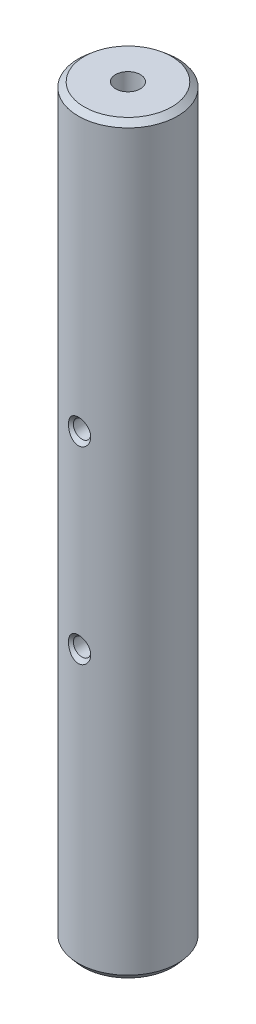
ISO-10303-21;
HEADER;
FILE_DESCRIPTION(('STEP AP214'),'2;1');
FILE_NAME('part.step','',(''),(''),'','','');
FILE_SCHEMA(('AUTOMOTIVE_DESIGN { 1 0 10303 214 1 1 1 1 }'));
ENDSEC;
DATA;
#1=APPLICATION_CONTEXT('core data for automotive mechanical design processes');
#2=APPLICATION_PROTOCOL_DEFINITION('international standard','automotive_design',2000,#1);
#3=PRODUCT_CONTEXT('',#1,'mechanical');
#4=PRODUCT('Part','Part','',(#3));
#5=PRODUCT_RELATED_PRODUCT_CATEGORY('part','',(#4));
#6=PRODUCT_DEFINITION_FORMATION('','',#4);
#7=PRODUCT_DEFINITION_CONTEXT('part definition',#1,'design');
#8=PRODUCT_DEFINITION('design','',#6,#7);
#9=PRODUCT_DEFINITION_SHAPE('','',#8);
#10=(LENGTH_UNIT() NAMED_UNIT(*) SI_UNIT(.MILLI.,.METRE.));
#11=(NAMED_UNIT(*) PLANE_ANGLE_UNIT() SI_UNIT($,.RADIAN.));
#12=(NAMED_UNIT(*) SI_UNIT($,.STERADIAN.) SOLID_ANGLE_UNIT());
#13=UNCERTAINTY_MEASURE_WITH_UNIT(LENGTH_MEASURE(1.E-05),#10,'distance_accuracy_value','');
#14=(GEOMETRIC_REPRESENTATION_CONTEXT(3) GLOBAL_UNCERTAINTY_ASSIGNED_CONTEXT((#13)) GLOBAL_UNIT_ASSIGNED_CONTEXT((#10,
#11,#12)) REPRESENTATION_CONTEXT('',''));
#15=CARTESIAN_POINT('',(0.,0.,0.));
#16=DIRECTION('',(0.,0.,1.));
#17=DIRECTION('',(1.,0.,0.));
#18=AXIS2_PLACEMENT_3D('',#15,#16,#17);
#19=CARTESIAN_POINT('',(0.,75.,0.));
#20=DIRECTION('',(0.,-1.,0.));
#21=DIRECTION('',(0.,0.,-1.));
#22=AXIS2_PLACEMENT_3D('',#19,#20,#21);
#23=CYLINDRICAL_SURFACE('',#22,10.);
#24=CARTESIAN_POINT('',(-1.66443172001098,-20.6738209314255,-9.86051064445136));
#25=CARTESIAN_POINT('',(-1.5911846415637,-20.7640959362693,-9.87287368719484));
#26=CARTESIAN_POINT('',(-1.51151795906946,-20.8491108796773,-9.88548411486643));
#27=CARTESIAN_POINT('',(-1.34032120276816,-21.0064165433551,-9.91014705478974));
#28=CARTESIAN_POINT('',(-1.24878905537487,-21.0787050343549,-9.92219946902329));
#29=CARTESIAN_POINT('',(-1.04205315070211,-21.2170296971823,-9.9461726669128));
#30=CARTESIAN_POINT('',(-0.925324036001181,-21.2808584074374,-9.95784998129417));
#31=CARTESIAN_POINT('',(-0.681651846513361,-21.3855290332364,-9.9774861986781));
#32=CARTESIAN_POINT('',(-0.55471379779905,-21.4263821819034,-9.98544691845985));
#33=CARTESIAN_POINT('',(-0.309137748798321,-21.4795032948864,-9.99589320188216));
#34=CARTESIAN_POINT('',(-0.191083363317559,-21.4943813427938,-9.99887711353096));
#35=CARTESIAN_POINT('',(0.0457957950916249,-21.5029794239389,-10.0005951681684));
#36=CARTESIAN_POINT('',(0.164620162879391,-21.4967098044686,-9.99933138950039));
#37=CARTESIAN_POINT('',(0.391476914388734,-21.46449584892,-9.99293737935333));
#38=CARTESIAN_POINT('',(0.49970708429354,-21.4398640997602,-9.98806523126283));
#39=CARTESIAN_POINT('',(0.710635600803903,-21.3736425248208,-9.97527794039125));
#40=CARTESIAN_POINT('',(0.813333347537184,-21.3320508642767,-9.96736246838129));
#41=CARTESIAN_POINT('',(1.014267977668,-21.2319507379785,-9.94895962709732));
#42=CARTESIAN_POINT('',(1.11223252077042,-21.1729127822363,-9.93839361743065));
#43=CARTESIAN_POINT('',(1.29792872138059,-21.0407360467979,-9.91585335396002));
#44=CARTESIAN_POINT('',(1.38565665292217,-20.9675921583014,-9.90387859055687));
#45=CARTESIAN_POINT('',(1.55787874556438,-20.8013896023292,-9.87832734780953));
#46=CARTESIAN_POINT('',(1.64114321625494,-20.7070636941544,-9.86471156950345));
#47=CARTESIAN_POINT('',(1.79246689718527,-20.5068178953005,-9.83834204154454));
#48=CARTESIAN_POINT('',(1.86051923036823,-20.400892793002,-9.8255886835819));
#49=CARTESIAN_POINT('',(1.98698254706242,-20.1683025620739,-9.80084186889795));
#50=CARTESIAN_POINT('',(2.04359007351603,-20.0406304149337,-9.78907468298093));
#51=CARTESIAN_POINT('',(2.13633142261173,-19.7777823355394,-9.76925490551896));
#52=CARTESIAN_POINT('',(2.17245898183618,-19.6426041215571,-9.76120345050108));
#53=CARTESIAN_POINT('',(2.22533204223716,-19.3594340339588,-9.74929216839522));
#54=CARTESIAN_POINT('',(2.24070856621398,-19.2111722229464,-9.74572935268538));
#55=CARTESIAN_POINT('',(2.24745027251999,-18.9140668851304,-9.74417650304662));
#56=CARTESIAN_POINT('',(2.23881195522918,-18.7652232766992,-9.74618728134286));
#57=CARTESIAN_POINT('',(2.19730163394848,-18.4684437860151,-9.75563048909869));
#58=CARTESIAN_POINT('',(2.16400696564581,-18.3205696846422,-9.7631574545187));
#59=CARTESIAN_POINT('',(2.07324823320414,-18.0327122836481,-9.78283109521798));
#60=CARTESIAN_POINT('',(2.01578079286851,-17.8927300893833,-9.79497841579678));
#61=CARTESIAN_POINT('',(1.87840205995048,-17.6265305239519,-9.82224210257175));
#62=CARTESIAN_POINT('',(1.79875020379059,-17.5001761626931,-9.83732357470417));
#63=CARTESIAN_POINT('',(1.61808195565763,-17.2638676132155,-9.86864653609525));
#64=CARTESIAN_POINT('',(1.51707008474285,-17.1539099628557,-9.88488777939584));
#65=CARTESIAN_POINT('',(1.30247669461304,-16.9611565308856,-9.91536989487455));
#66=CARTESIAN_POINT('',(1.19002137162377,-16.8771221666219,-9.92967233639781));
#67=CARTESIAN_POINT('',(0.950905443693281,-16.7319274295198,-9.95540831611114));
#68=CARTESIAN_POINT('',(0.824260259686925,-16.6707425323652,-9.96684492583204));
#69=CARTESIAN_POINT('',(0.576206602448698,-16.5805220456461,-9.98406791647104));
#70=CARTESIAN_POINT('',(0.455887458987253,-16.5485859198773,-9.99035491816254));
#71=CARTESIAN_POINT('',(0.211302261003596,-16.507360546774,-9.9985134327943));
#72=CARTESIAN_POINT('',(0.0870390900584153,-16.4980551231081,-10.0003880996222));
#73=CARTESIAN_POINT('',(-0.149119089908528,-16.5024096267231,-9.99951887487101));
#74=CARTESIAN_POINT('',(-0.261060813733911,-16.5139591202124,-9.99719938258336));
#75=CARTESIAN_POINT('',(-0.481340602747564,-16.5554027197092,-9.98901687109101));
#76=CARTESIAN_POINT('',(-0.589678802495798,-16.5852961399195,-9.98315398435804));
#77=CARTESIAN_POINT('',(-0.79978471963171,-16.6619688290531,-9.96852241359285));
#78=CARTESIAN_POINT('',(-0.901560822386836,-16.7087260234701,-9.9597575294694));
#79=CARTESIAN_POINT('',(-1.09653558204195,-16.817235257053,-9.94018243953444));
#80=CARTESIAN_POINT('',(-1.18973183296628,-16.8789914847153,-9.92937166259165));
#81=CARTESIAN_POINT('',(-1.37335201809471,-17.0211610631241,-9.90571488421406));
#82=CARTESIAN_POINT('',(-1.4628862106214,-17.1027055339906,-9.89277421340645));
#83=CARTESIAN_POINT('',(-1.62860799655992,-17.2783629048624,-9.86684783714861));
#84=CARTESIAN_POINT('',(-1.70478954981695,-17.3724814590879,-9.85386211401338));
#85=CARTESIAN_POINT('',(-1.85056779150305,-17.5819327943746,-9.82758851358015));
#86=CARTESIAN_POINT('',(-1.91847239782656,-17.6984609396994,-9.8144295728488));
#87=CARTESIAN_POINT('',(-2.03563896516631,-17.9407897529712,-9.79079940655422));
#88=CARTESIAN_POINT('',(-2.08489402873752,-18.0665938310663,-9.78032917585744));
#89=CARTESIAN_POINT('',(-2.16734187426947,-18.3349530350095,-9.76240615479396));
#90=CARTESIAN_POINT('',(-2.19889132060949,-18.4780366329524,-9.75527022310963));
#91=CARTESIAN_POINT('',(-2.23888344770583,-18.767565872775,-9.74616959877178));
#92=CARTESIAN_POINT('',(-2.24732128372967,-18.9140122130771,-9.74420599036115));
#93=CARTESIAN_POINT('',(-2.24084504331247,-19.2109796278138,-9.74569815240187));
#94=CARTESIAN_POINT('',(-2.22518940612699,-19.3614842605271,-9.74932602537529));
#95=CARTESIAN_POINT('',(-2.16939584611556,-19.6576853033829,-9.76189178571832));
#96=CARTESIAN_POINT('',(-2.12925632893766,-19.8033813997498,-9.7708300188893));
#97=CARTESIAN_POINT('',(-2.0285887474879,-20.0764341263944,-9.79220500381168));
#98=CARTESIAN_POINT('',(-1.96956320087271,-20.2043670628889,-9.80437519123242));
#99=CARTESIAN_POINT('',(-1.83159645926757,-20.44867837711,-9.83108215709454));
#100=CARTESIAN_POINT('',(-1.7526724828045,-20.5650666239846,-9.84561688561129));
#101=CARTESIAN_POINT('',(-1.66443172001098,-20.6738209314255,-9.86051064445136));
#102=B_SPLINE_CURVE_WITH_KNOTS('',3,(#24,#25,#26,#27,#28,#29,#30,#31,#32,#33,#34,#35,#36,#37,
#38,#39,#40,#41,#42,#43,#44,#45,#46,#47,#48,#49,#50,#51,#52,#53,#54,#55,#56,#57,#58,#59,#60,#61,
#62,#63,#64,#65,#66,#67,#68,#69,#70,#71,#72,#73,#74,#75,#76,#77,#78,#79,#80,#81,#82,#83,#84,#85,
#86,#87,#88,#89,#90,#91,#92,#93,#94,#95,#96,#97,#98,#99,#100,#101),.UNSPECIFIED.,.T.,.F.,(4,2,2,
2,2,2,2,2,2,2,2,2,2,2,2,2,2,2,2,2,2,2,2,2,2,2,2,2,2,2,2,2,2,2,2,2,2,2,4),(0.,0.350370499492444,
0.700802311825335,1.09916404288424,1.49733083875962,1.85250781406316,2.20751103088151,
2.53931359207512,2.87115205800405,3.21432955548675,3.55763157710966,3.93574068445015,
4.31402038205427,4.73266184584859,5.15143127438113,5.5966621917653,6.0419579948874,
6.49506918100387,6.94824367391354,7.39632625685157,7.84431409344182,8.26527092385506,
8.68577463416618,9.0576281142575,9.42921571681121,9.76527968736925,10.1013310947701,
10.436944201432,10.7726511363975,11.1365442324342,11.5006015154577,11.905417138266,
12.3103823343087,12.7484713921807,13.1866522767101,13.6385918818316,14.0905609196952,
14.5130166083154,14.9351079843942),.UNSPECIFIED.);
#103=CARTESIAN_POINT('',(-1.66443172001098,-20.6738209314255,-9.86051064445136));
#104=VERTEX_POINT('',#103);
#105=EDGE_CURVE('E11',#104,#104,#102,.T.);
#106=ORIENTED_EDGE('',*,*,#105,.T.);
#107=EDGE_LOOP('',(#106));
#108=FACE_BOUND('',#107,.T.);
#109=CARTESIAN_POINT('',(-1.66443172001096,-20.6738209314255,9.86051064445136));
#110=CARTESIAN_POINT('',(-1.75442282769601,-20.5629046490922,9.84532137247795));
#111=CARTESIAN_POINT('',(-1.83477981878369,-20.4439717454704,9.83049538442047));
#112=CARTESIAN_POINT('',(-1.97480820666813,-20.1940886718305,9.80332847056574));
#113=CARTESIAN_POINT('',(-2.0344417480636,-20.0631170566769,9.79099210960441));
#114=CARTESIAN_POINT('',(-2.13217829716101,-19.7925572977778,9.7701754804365));
#115=CARTESIAN_POINT('',(-2.17020468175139,-19.6529404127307,9.76170895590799));
#116=CARTESIAN_POINT('',(-2.22379535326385,-19.3693310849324,9.74964065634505));
#117=CARTESIAN_POINT('',(-2.23936799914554,-19.2253402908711,9.74603707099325));
#118=CARTESIAN_POINT('',(-2.24801253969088,-18.9305946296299,9.74404802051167));
#119=CARTESIAN_POINT('',(-2.2401156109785,-18.7798088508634,9.74588722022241));
#120=CARTESIAN_POINT('',(-2.19982916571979,-18.4816762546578,9.75505866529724));
#121=CARTESIAN_POINT('',(-2.16743328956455,-18.3343303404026,9.76239233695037));
#122=CARTESIAN_POINT('',(-2.07854168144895,-18.046871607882,9.7817038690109));
#123=CARTESIAN_POINT('',(-2.02196884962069,-17.9067835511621,9.79369657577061));
#124=CARTESIAN_POINT('',(-1.8856204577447,-17.6386577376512,9.82085786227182));
#125=CARTESIAN_POINT('',(-1.80584363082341,-17.5106206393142,9.83602661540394));
#126=CARTESIAN_POINT('',(-1.62726017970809,-17.2748243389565,9.8671154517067));
#127=CARTESIAN_POINT('',(-1.52911134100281,-17.1665641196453,9.88299828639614));
#128=CARTESIAN_POINT('',(-1.31425134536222,-16.9701389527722,9.91385218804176));
#129=CARTESIAN_POINT('',(-1.19755270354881,-16.8819605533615,9.92882386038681));
#130=CARTESIAN_POINT('',(-0.96008810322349,-16.7372679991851,9.9544535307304));
#131=CARTESIAN_POINT('',(-0.840671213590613,-16.6785948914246,9.96538087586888));
#132=CARTESIAN_POINT('',(-0.592617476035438,-16.5849414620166,9.98319510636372));
#133=CARTESIAN_POINT('',(-0.463990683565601,-16.549935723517,9.99008632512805));
#134=CARTESIAN_POINT('',(-0.217765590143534,-16.5084641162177,9.99829633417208));
#135=CARTESIAN_POINT('',(-0.100667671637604,-16.4991067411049,10.0001789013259));
#136=CARTESIAN_POINT('',(0.133335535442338,-16.5010266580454,9.99979441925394));
#137=CARTESIAN_POINT('',(0.250240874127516,-16.5122972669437,9.99752871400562));
#138=CARTESIAN_POINT('',(0.473898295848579,-16.5536673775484,9.98935844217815));
#139=CARTESIAN_POINT('',(0.580856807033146,-16.5827096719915,9.98365844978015));
#140=CARTESIAN_POINT('',(0.788617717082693,-16.6573189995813,9.96939995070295));
#141=CARTESIAN_POINT('',(0.889419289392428,-16.7028882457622,9.96084106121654));
#142=CARTESIAN_POINT('',(1.08712614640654,-16.8111553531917,9.94125151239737));
#143=CARTESIAN_POINT('',(1.18364501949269,-16.8745386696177,9.93012604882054));
#144=CARTESIAN_POINT('',(1.36586015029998,-17.0151089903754,9.90670896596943));
#145=CARTESIAN_POINT('',(1.45155219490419,-17.0923013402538,9.89441689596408));
#146=CARTESIAN_POINT('',(1.61929472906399,-17.2669955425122,9.86842636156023));
#147=CARTESIAN_POINT('',(1.70000608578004,-17.365781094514,9.85471640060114));
#148=CARTESIAN_POINT('',(1.84555555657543,-17.5745612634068,9.82849961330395));
#149=CARTESIAN_POINT('',(1.9103865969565,-17.6845608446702,9.81599332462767));
#150=CARTESIAN_POINT('',(2.02920001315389,-17.924851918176,9.79216049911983));
#151=CARTESIAN_POINT('',(2.08137269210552,-18.0560660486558,9.7810888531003));
#152=CARTESIAN_POINT('',(2.16464818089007,-18.3252843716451,9.76299738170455));
#153=CARTESIAN_POINT('',(2.19574511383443,-18.4632904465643,9.75597868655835));
#154=CARTESIAN_POINT('',(2.23754969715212,-18.7505196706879,9.74648014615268));
#155=CARTESIAN_POINT('',(2.24700519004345,-18.8999358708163,9.74427935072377));
#156=CARTESIAN_POINT('',(2.24169957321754,-19.1983249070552,9.74550078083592));
#157=CARTESIAN_POINT('',(2.22693509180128,-19.3472976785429,9.74892378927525));
#158=CARTESIAN_POINT('',(2.17307244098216,-19.6426514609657,9.76107195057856));
#159=CARTESIAN_POINT('',(2.13364928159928,-19.7889705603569,9.76986787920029));
#160=CARTESIAN_POINT('',(2.03082375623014,-20.0726376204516,9.79175690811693));
#161=CARTESIAN_POINT('',(1.96741819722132,-20.2099843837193,9.80485058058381));
#162=CARTESIAN_POINT('',(1.81884313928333,-20.4692669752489,9.83348506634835));
#163=CARTESIAN_POINT('',(1.73402664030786,-20.5914088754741,9.8489847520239));
#164=CARTESIAN_POINT('',(1.54364149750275,-20.8182764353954,9.88060955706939));
#165=CARTESIAN_POINT('',(1.438079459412,-20.923007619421,9.8967344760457));
#166=CARTESIAN_POINT('',(1.21641569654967,-21.1038605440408,9.92632586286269));
#167=CARTESIAN_POINT('',(1.10153141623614,-21.1814506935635,9.93989877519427));
#168=CARTESIAN_POINT('',(0.858798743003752,-21.3133616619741,9.96379700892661));
#169=CARTESIAN_POINT('',(0.730964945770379,-21.3677083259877,9.97412593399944));
#170=CARTESIAN_POINT('',(0.482417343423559,-21.4448763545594,9.98903878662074));
#171=CARTESIAN_POINT('',(0.362657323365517,-21.4706722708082,9.99415880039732));
#172=CARTESIAN_POINT('',(0.120359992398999,-21.5000815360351,10.000007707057));
#173=CARTESIAN_POINT('',(-0.00217548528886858,-21.5037091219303,10.0007394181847));
#174=CARTESIAN_POINT('',(-0.235208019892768,-21.4892556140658,9.99785436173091));
#175=CARTESIAN_POINT('',(-0.345830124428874,-21.4730238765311,9.99460800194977));
#176=CARTESIAN_POINT('',(-0.562787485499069,-21.4227229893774,9.98474168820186));
#177=CARTESIAN_POINT('',(-0.669121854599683,-21.3886501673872,9.97812103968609));
#178=CARTESIAN_POINT('',(-0.876057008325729,-21.3037064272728,9.96210022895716));
#179=CARTESIAN_POINT('',(-0.976574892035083,-21.2526411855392,9.95266805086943));
#180=CARTESIAN_POINT('',(-1.16838712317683,-21.1358554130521,9.93197773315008));
#181=CARTESIAN_POINT('',(-1.25968656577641,-21.0701430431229,9.92072061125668));
#182=CARTESIAN_POINT('',(-1.40387336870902,-20.9494448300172,9.90114157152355));
#183=CARTESIAN_POINT('',(-1.45965800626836,-20.8978262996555,9.89304278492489));
#184=CARTESIAN_POINT('',(-1.56601345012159,-20.7895008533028,9.87676531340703));
#185=CARTESIAN_POINT('',(-1.61658434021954,-20.7327940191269,9.86858662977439));
#186=CARTESIAN_POINT('',(-1.66443172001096,-20.6738209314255,9.86051064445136));
#187=B_SPLINE_CURVE_WITH_KNOTS('',3,(#109,#110,#111,#112,#113,#114,#115,#116,#117,#118,#119,
#120,#121,#122,#123,#124,#125,#126,#127,#128,#129,#130,#131,#132,#133,#134,#135,#136,#137,#138,
#139,#140,#141,#142,#143,#144,#145,#146,#147,#148,#149,#150,#151,#152,#153,#154,#155,#156,#157,
#158,#159,#160,#161,#162,#163,#164,#165,#166,#167,#168,#169,#170,#171,#172,#173,#174,#175,#176,
#177,#178,#179,#180,#181,#182,#183,#184,#185,#186),.UNSPECIFIED.,.T.,.F.,(4,2,2,2,2,2,2,2,2,2,2,
2,2,2,2,2,2,2,2,2,2,2,2,2,2,2,2,2,2,2,2,2,2,2,2,2,2,2,4),(0.,0.430626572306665,
0.862035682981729,1.29496525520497,1.72773361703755,2.17861138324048,2.62960623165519,
3.08205015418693,3.5345187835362,3.97312723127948,4.41144100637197,4.80965115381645,
5.20743297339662,5.55805620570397,5.90856586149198,6.24001545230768,6.57150944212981,
6.91809772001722,7.26482045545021,7.64814118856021,8.03163235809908,8.45469425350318,
8.87787406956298,9.32497936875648,9.77214691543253,10.2253358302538,10.6785851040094,
11.124800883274,11.5708748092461,11.9863899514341,12.4014418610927,12.7672666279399,
13.1328564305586,13.4668452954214,13.8009029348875,14.1389202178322,14.4767496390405,
14.7057131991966,14.9346730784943),.UNSPECIFIED.);
#188=CARTESIAN_POINT('',(-1.66443172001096,-20.6738209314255,9.86051064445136));
#189=VERTEX_POINT('',#188);
#190=EDGE_CURVE('E49',#189,#189,#187,.T.);
#191=ORIENTED_EDGE('',*,*,#190,.T.);
#192=EDGE_LOOP('',(#191));
#193=FACE_BOUND('',#192,.T.);
#194=CARTESIAN_POINT('',(-1.66443172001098,17.3261790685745,-9.86051064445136));
#195=CARTESIAN_POINT('',(-1.5911846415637,17.2359040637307,-9.87287368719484));
#196=CARTESIAN_POINT('',(-1.51151795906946,17.1508891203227,-9.88548411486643));
#197=CARTESIAN_POINT('',(-1.34032120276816,16.9935834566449,-9.91014705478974));
#198=CARTESIAN_POINT('',(-1.24878905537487,16.921294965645,-9.92219946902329));
#199=CARTESIAN_POINT('',(-1.04205315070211,16.7829703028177,-9.9461726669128));
#200=CARTESIAN_POINT('',(-0.925324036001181,16.7191415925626,-9.95784998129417));
#201=CARTESIAN_POINT('',(-0.681651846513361,16.6144709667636,-9.9774861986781));
#202=CARTESIAN_POINT('',(-0.55471379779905,16.5736178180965,-9.98544691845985));
#203=CARTESIAN_POINT('',(-0.309137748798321,16.5204967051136,-9.99589320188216));
#204=CARTESIAN_POINT('',(-0.191083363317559,16.5056186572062,-9.99887711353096));
#205=CARTESIAN_POINT('',(0.045795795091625,16.4970205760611,-10.0005951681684));
#206=CARTESIAN_POINT('',(0.164620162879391,16.5032901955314,-9.99933138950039));
#207=CARTESIAN_POINT('',(0.391476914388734,16.53550415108,-9.99293737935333));
#208=CARTESIAN_POINT('',(0.49970708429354,16.5601359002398,-9.98806523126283));
#209=CARTESIAN_POINT('',(0.710635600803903,16.6263574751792,-9.97527794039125));
#210=CARTESIAN_POINT('',(0.813333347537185,16.6679491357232,-9.96736246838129));
#211=CARTESIAN_POINT('',(1.014267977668,16.7680492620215,-9.94895962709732));
#212=CARTESIAN_POINT('',(1.11223252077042,16.8270872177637,-9.93839361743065));
#213=CARTESIAN_POINT('',(1.29792872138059,16.959263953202,-9.91585335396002));
#214=CARTESIAN_POINT('',(1.38565665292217,17.0324078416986,-9.90387859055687));
#215=CARTESIAN_POINT('',(1.55787874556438,17.1986103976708,-9.87832734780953));
#216=CARTESIAN_POINT('',(1.64114321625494,17.2929363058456,-9.86471156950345));
#217=CARTESIAN_POINT('',(1.79246689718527,17.4931821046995,-9.83834204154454));
#218=CARTESIAN_POINT('',(1.86051923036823,17.5991072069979,-9.8255886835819));
#219=CARTESIAN_POINT('',(1.98698254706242,17.8316974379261,-9.80084186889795));
#220=CARTESIAN_POINT('',(2.04359007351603,17.9593695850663,-9.78907468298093));
#221=CARTESIAN_POINT('',(2.13633142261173,18.2222176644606,-9.76925490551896));
#222=CARTESIAN_POINT('',(2.17245898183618,18.3573958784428,-9.76120345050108));
#223=CARTESIAN_POINT('',(2.22533204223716,18.6405659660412,-9.74929216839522));
#224=CARTESIAN_POINT('',(2.24070856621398,18.7888277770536,-9.74572935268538));
#225=CARTESIAN_POINT('',(2.24745027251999,19.0859331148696,-9.74417650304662));
#226=CARTESIAN_POINT('',(2.23881195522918,19.2347767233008,-9.74618728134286));
#227=CARTESIAN_POINT('',(2.19730163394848,19.5315562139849,-9.75563048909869));
#228=CARTESIAN_POINT('',(2.16400696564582,19.6794303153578,-9.7631574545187));
#229=CARTESIAN_POINT('',(2.07324823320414,19.9672877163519,-9.78283109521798));
#230=CARTESIAN_POINT('',(2.01578079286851,20.1072699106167,-9.79497841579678));
#231=CARTESIAN_POINT('',(1.87840205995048,20.3734694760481,-9.82224210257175));
#232=CARTESIAN_POINT('',(1.79875020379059,20.4998238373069,-9.83732357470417));
#233=CARTESIAN_POINT('',(1.61808195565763,20.7361323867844,-9.86864653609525));
#234=CARTESIAN_POINT('',(1.51707008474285,20.8460900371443,-9.88488777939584));
#235=CARTESIAN_POINT('',(1.30247669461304,21.0388434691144,-9.91536989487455));
#236=CARTESIAN_POINT('',(1.19002137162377,21.122877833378,-9.92967233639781));
#237=CARTESIAN_POINT('',(0.95090544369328,21.2680725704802,-9.95540831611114));
#238=CARTESIAN_POINT('',(0.824260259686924,21.3292574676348,-9.96684492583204));
#239=CARTESIAN_POINT('',(0.576206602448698,21.4194779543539,-9.98406791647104));
#240=CARTESIAN_POINT('',(0.455887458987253,21.4514140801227,-9.99035491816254));
#241=CARTESIAN_POINT('',(0.211302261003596,21.492639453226,-9.9985134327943));
#242=CARTESIAN_POINT('',(0.0870390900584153,21.5019448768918,-10.0003880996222));
#243=CARTESIAN_POINT('',(-0.149119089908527,21.4975903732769,-9.99951887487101));
#244=CARTESIAN_POINT('',(-0.26106081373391,21.4860408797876,-9.99719938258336));
#245=CARTESIAN_POINT('',(-0.481340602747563,21.4445972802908,-9.98901687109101));
#246=CARTESIAN_POINT('',(-0.589678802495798,21.4147038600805,-9.98315398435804));
#247=CARTESIAN_POINT('',(-0.79978471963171,21.3380311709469,-9.96852241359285));
#248=CARTESIAN_POINT('',(-0.901560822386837,21.2912739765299,-9.9597575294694));
#249=CARTESIAN_POINT('',(-1.09653558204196,21.182764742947,-9.94018243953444));
#250=CARTESIAN_POINT('',(-1.18973183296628,21.1210085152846,-9.92937166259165));
#251=CARTESIAN_POINT('',(-1.37335201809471,20.9788389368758,-9.90571488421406));
#252=CARTESIAN_POINT('',(-1.4628862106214,20.8972944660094,-9.89277421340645));
#253=CARTESIAN_POINT('',(-1.62860799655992,20.7216370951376,-9.86684783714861));
#254=CARTESIAN_POINT('',(-1.70478954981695,20.6275185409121,-9.85386211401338));
#255=CARTESIAN_POINT('',(-1.85056779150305,20.4180672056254,-9.82758851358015));
#256=CARTESIAN_POINT('',(-1.91847239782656,20.3015390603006,-9.8144295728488));
#257=CARTESIAN_POINT('',(-2.03563896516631,20.0592102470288,-9.79079940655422));
#258=CARTESIAN_POINT('',(-2.08489402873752,19.9334061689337,-9.78032917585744));
#259=CARTESIAN_POINT('',(-2.16734187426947,19.6650469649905,-9.76240615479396));
#260=CARTESIAN_POINT('',(-2.19889132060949,19.5219633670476,-9.75527022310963));
#261=CARTESIAN_POINT('',(-2.23888344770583,19.232434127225,-9.74616959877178));
#262=CARTESIAN_POINT('',(-2.24732128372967,19.0859877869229,-9.74420599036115));
#263=CARTESIAN_POINT('',(-2.24084504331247,18.7890203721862,-9.74569815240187));
#264=CARTESIAN_POINT('',(-2.22518940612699,18.6385157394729,-9.74932602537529));
#265=CARTESIAN_POINT('',(-2.16939584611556,18.342314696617,-9.76189178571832));
#266=CARTESIAN_POINT('',(-2.12925632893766,18.1966186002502,-9.7708300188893));
#267=CARTESIAN_POINT('',(-2.0285887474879,17.9235658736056,-9.79220500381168));
#268=CARTESIAN_POINT('',(-1.96956320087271,17.7956329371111,-9.80437519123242));
#269=CARTESIAN_POINT('',(-1.83159645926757,17.55132162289,-9.83108215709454));
#270=CARTESIAN_POINT('',(-1.75267248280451,17.4349333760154,-9.84561688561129));
#271=CARTESIAN_POINT('',(-1.66443172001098,17.3261790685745,-9.86051064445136));
#272=B_SPLINE_CURVE_WITH_KNOTS('',3,(#194,#195,#196,#197,#198,#199,#200,#201,#202,#203,#204,
#205,#206,#207,#208,#209,#210,#211,#212,#213,#214,#215,#216,#217,#218,#219,#220,#221,#222,#223,
#224,#225,#226,#227,#228,#229,#230,#231,#232,#233,#234,#235,#236,#237,#238,#239,#240,#241,#242,
#243,#244,#245,#246,#247,#248,#249,#250,#251,#252,#253,#254,#255,#256,#257,#258,#259,#260,#261,
#262,#263,#264,#265,#266,#267,#268,#269,#270,#271),.UNSPECIFIED.,.T.,.F.,(4,2,2,2,2,2,2,2,2,2,2,
2,2,2,2,2,2,2,2,2,2,2,2,2,2,2,2,2,2,2,2,2,2,2,2,2,2,2,4),(0.,0.350370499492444,
0.700802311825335,1.09916404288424,1.49733083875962,1.85250781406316,2.20751103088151,
2.53931359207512,2.87115205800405,3.21432955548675,3.55763157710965,3.93574068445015,
4.31402038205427,4.73266184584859,5.15143127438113,5.5966621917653,6.0419579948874,
6.49506918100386,6.94824367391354,7.39632625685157,7.84431409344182,8.26527092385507,
8.68577463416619,9.0576281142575,9.42921571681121,9.76527968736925,10.1013310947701,
10.436944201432,10.7726511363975,11.1365442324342,11.5006015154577,11.905417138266,
12.3103823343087,12.7484713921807,13.1866522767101,13.6385918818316,14.0905609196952,
14.5130166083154,14.9351079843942),.UNSPECIFIED.);
#273=CARTESIAN_POINT('',(-1.66443172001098,17.3261790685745,-9.86051064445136));
#274=VERTEX_POINT('',#273);
#275=EDGE_CURVE('E121',#274,#274,#272,.T.);
#276=ORIENTED_EDGE('',*,*,#275,.T.);
#277=EDGE_LOOP('',(#276));
#278=FACE_BOUND('',#277,.T.);
#279=CARTESIAN_POINT('',(-1.66443172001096,17.3261790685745,9.86051064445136));
#280=CARTESIAN_POINT('',(-1.75442282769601,17.4370953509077,9.84532137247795));
#281=CARTESIAN_POINT('',(-1.83477981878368,17.5560282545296,9.83049538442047));
#282=CARTESIAN_POINT('',(-1.97480820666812,17.8059113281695,9.80332847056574));
#283=CARTESIAN_POINT('',(-2.0344417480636,17.9368829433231,9.79099210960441));
#284=CARTESIAN_POINT('',(-2.13217829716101,18.2074427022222,9.7701754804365));
#285=CARTESIAN_POINT('',(-2.17020468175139,18.3470595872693,9.76170895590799));
#286=CARTESIAN_POINT('',(-2.22379535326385,18.6306689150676,9.74964065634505));
#287=CARTESIAN_POINT('',(-2.23936799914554,18.7746597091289,9.74603707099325));
#288=CARTESIAN_POINT('',(-2.24801253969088,19.0694053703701,9.74404802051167));
#289=CARTESIAN_POINT('',(-2.2401156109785,19.2201911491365,9.74588722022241));
#290=CARTESIAN_POINT('',(-2.19982916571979,19.5183237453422,9.75505866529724));
#291=CARTESIAN_POINT('',(-2.16743328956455,19.6656696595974,9.76239233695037));
#292=CARTESIAN_POINT('',(-2.07854168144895,19.9531283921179,9.7817038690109));
#293=CARTESIAN_POINT('',(-2.02196884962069,20.0932164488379,9.79369657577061));
#294=CARTESIAN_POINT('',(-1.8856204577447,20.3613422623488,9.82085786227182));
#295=CARTESIAN_POINT('',(-1.80584363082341,20.4893793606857,9.83602661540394));
#296=CARTESIAN_POINT('',(-1.62726017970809,20.7251756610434,9.8671154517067));
#297=CARTESIAN_POINT('',(-1.52911134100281,20.8334358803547,9.88299828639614));
#298=CARTESIAN_POINT('',(-1.31425134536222,21.0298610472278,9.91385218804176));
#299=CARTESIAN_POINT('',(-1.19755270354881,21.1180394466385,9.92882386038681));
#300=CARTESIAN_POINT('',(-0.960088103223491,21.2627320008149,9.9544535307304));
#301=CARTESIAN_POINT('',(-0.840671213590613,21.3214051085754,9.96538087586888));
#302=CARTESIAN_POINT('',(-0.592617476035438,21.4150585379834,9.98319510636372));
#303=CARTESIAN_POINT('',(-0.463990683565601,21.450064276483,9.99008632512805));
#304=CARTESIAN_POINT('',(-0.217765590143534,21.4915358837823,9.99829633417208));
#305=CARTESIAN_POINT('',(-0.100667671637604,21.5008932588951,10.0001789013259));
#306=CARTESIAN_POINT('',(0.133335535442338,21.4989733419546,9.99979441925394));
#307=CARTESIAN_POINT('',(0.250240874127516,21.4877027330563,9.99752871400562));
#308=CARTESIAN_POINT('',(0.473898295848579,21.4463326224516,9.98935844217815));
#309=CARTESIAN_POINT('',(0.580856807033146,21.4172903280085,9.98365844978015));
#310=CARTESIAN_POINT('',(0.788617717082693,21.3426810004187,9.96939995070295));
#311=CARTESIAN_POINT('',(0.889419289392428,21.2971117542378,9.96084106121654));
#312=CARTESIAN_POINT('',(1.08712614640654,21.1888446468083,9.94125151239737));
#313=CARTESIAN_POINT('',(1.18364501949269,21.1254613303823,9.93012604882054));
#314=CARTESIAN_POINT('',(1.36586015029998,20.9848910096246,9.90670896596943));
#315=CARTESIAN_POINT('',(1.45155219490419,20.9076986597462,9.89441689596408));
#316=CARTESIAN_POINT('',(1.61929472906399,20.7330044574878,9.86842636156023));
#317=CARTESIAN_POINT('',(1.70000608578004,20.634218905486,9.85471640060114));
#318=CARTESIAN_POINT('',(1.84555555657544,20.4254387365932,9.82849961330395));
#319=CARTESIAN_POINT('',(1.9103865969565,20.3154391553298,9.81599332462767));
#320=CARTESIAN_POINT('',(2.02920001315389,20.075148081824,9.79216049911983));
#321=CARTESIAN_POINT('',(2.08137269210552,19.9439339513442,9.7810888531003));
#322=CARTESIAN_POINT('',(2.16464818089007,19.6747156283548,9.76299738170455));
#323=CARTESIAN_POINT('',(2.19574511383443,19.5367095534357,9.75597868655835));
#324=CARTESIAN_POINT('',(2.23754969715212,19.2494803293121,9.74648014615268));
#325=CARTESIAN_POINT('',(2.24700519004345,19.1000641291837,9.74427935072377));
#326=CARTESIAN_POINT('',(2.24169957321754,18.8016750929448,9.74550078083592));
#327=CARTESIAN_POINT('',(2.22693509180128,18.6527023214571,9.74892378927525));
#328=CARTESIAN_POINT('',(2.17307244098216,18.3573485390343,9.76107195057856));
#329=CARTESIAN_POINT('',(2.13364928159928,18.2110294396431,9.76986787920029));
#330=CARTESIAN_POINT('',(2.03082375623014,17.9273623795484,9.79175690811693));
#331=CARTESIAN_POINT('',(1.96741819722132,17.7900156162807,9.80485058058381));
#332=CARTESIAN_POINT('',(1.81884313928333,17.5307330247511,9.83348506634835));
#333=CARTESIAN_POINT('',(1.73402664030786,17.4085911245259,9.8489847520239));
#334=CARTESIAN_POINT('',(1.54364149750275,17.1817235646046,9.88060955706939));
#335=CARTESIAN_POINT('',(1.438079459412,17.076992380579,9.8967344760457));
#336=CARTESIAN_POINT('',(1.21641569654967,16.8961394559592,9.92632586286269));
#337=CARTESIAN_POINT('',(1.10153141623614,16.8185493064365,9.93989877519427));
#338=CARTESIAN_POINT('',(0.858798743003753,16.6866383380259,9.96379700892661));
#339=CARTESIAN_POINT('',(0.73096494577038,16.6322916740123,9.97412593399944));
#340=CARTESIAN_POINT('',(0.482417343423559,16.5551236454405,9.98903878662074));
#341=CARTESIAN_POINT('',(0.362657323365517,16.5293277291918,9.99415880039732));
#342=CARTESIAN_POINT('',(0.120359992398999,16.4999184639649,10.000007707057));
#343=CARTESIAN_POINT('',(-0.00217548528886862,16.4962908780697,10.0007394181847));
#344=CARTESIAN_POINT('',(-0.235208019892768,16.5107443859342,9.99785436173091));
#345=CARTESIAN_POINT('',(-0.345830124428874,16.5269761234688,9.99460800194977));
#346=CARTESIAN_POINT('',(-0.562787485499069,16.5772770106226,9.98474168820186));
#347=CARTESIAN_POINT('',(-0.669121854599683,16.6113498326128,9.97812103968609));
#348=CARTESIAN_POINT('',(-0.87605700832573,16.6962935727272,9.96210022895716));
#349=CARTESIAN_POINT('',(-0.976574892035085,16.7473588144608,9.95266805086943));
#350=CARTESIAN_POINT('',(-1.16838712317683,16.8641445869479,9.93197773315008));
#351=CARTESIAN_POINT('',(-1.25968656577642,16.9298569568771,9.92072061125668));
#352=CARTESIAN_POINT('',(-1.40387336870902,17.0505551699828,9.90114157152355));
#353=CARTESIAN_POINT('',(-1.45965800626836,17.1021737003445,9.89304278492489));
#354=CARTESIAN_POINT('',(-1.56601345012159,17.2104991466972,9.87676531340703));
#355=CARTESIAN_POINT('',(-1.61658434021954,17.2672059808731,9.86858662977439));
#356=CARTESIAN_POINT('',(-1.66443172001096,17.3261790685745,9.86051064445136));
#357=B_SPLINE_CURVE_WITH_KNOTS('',3,(#279,#280,#281,#282,#283,#284,#285,#286,#287,#288,#289,
#290,#291,#292,#293,#294,#295,#296,#297,#298,#299,#300,#301,#302,#303,#304,#305,#306,#307,#308,
#309,#310,#311,#312,#313,#314,#315,#316,#317,#318,#319,#320,#321,#322,#323,#324,#325,#326,#327,
#328,#329,#330,#331,#332,#333,#334,#335,#336,#337,#338,#339,#340,#341,#342,#343,#344,#345,#346,
#347,#348,#349,#350,#351,#352,#353,#354,#355,#356),.UNSPECIFIED.,.T.,.F.,(4,2,2,2,2,2,2,2,2,2,2,
2,2,2,2,2,2,2,2,2,2,2,2,2,2,2,2,2,2,2,2,2,2,2,2,2,2,2,4),(0.,0.43062657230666,0.862035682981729,
1.29496525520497,1.72773361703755,2.17861138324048,2.62960623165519,3.08205015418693,
3.5345187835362,3.97312723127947,4.41144100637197,4.80965115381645,5.20743297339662,
5.55805620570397,5.90856586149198,6.24001545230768,6.57150944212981,6.91809772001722,
7.26482045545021,7.64814118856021,8.03163235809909,8.45469425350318,8.87787406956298,
9.32497936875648,9.77214691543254,10.2253358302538,10.6785851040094,11.124800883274,
11.5708748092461,11.9863899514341,12.4014418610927,12.7672666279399,13.1328564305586,
13.4668452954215,13.8009029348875,14.1389202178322,14.4767496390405,14.7057131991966,
14.9346730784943),.UNSPECIFIED.);
#358=CARTESIAN_POINT('',(-1.66443172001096,17.3261790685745,9.86051064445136));
#359=VERTEX_POINT('',#358);
#360=EDGE_CURVE('E113',#359,#359,#357,.T.);
#361=ORIENTED_EDGE('',*,*,#360,.T.);
#362=EDGE_LOOP('',(#361));
#363=FACE_BOUND('',#362,.T.);
#364=CARTESIAN_POINT('',(0.,-73.8082464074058,0.));
#365=DIRECTION('',(0.,1.,0.));
#366=DIRECTION('',(0.,0.,1.));
#367=AXIS2_PLACEMENT_3D('',#364,#365,#366);
#368=CIRCLE('',#367,10.);
#369=CARTESIAN_POINT('',(0.,-73.8082464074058,10.));
#370=VERTEX_POINT('',#369);
#371=EDGE_CURVE('E104',#370,#370,#368,.T.);
#372=ORIENTED_EDGE('',*,*,#371,.T.);
#373=EDGE_LOOP('',(#372));
#374=FACE_BOUND('',#373,.T.);
#375=CARTESIAN_POINT('',(0.,74.,0.));
#376=DIRECTION('',(0.,1.,0.));
#377=DIRECTION('',(0.,0.,1.));
#378=AXIS2_PLACEMENT_3D('',#375,#376,#377);
#379=CIRCLE('',#378,10.);
#380=CARTESIAN_POINT('',(0.,74.,10.));
#381=VERTEX_POINT('',#380);
#382=EDGE_CURVE('E101',#381,#381,#379,.F.);
#383=ORIENTED_EDGE('',*,*,#382,.T.);
#384=EDGE_LOOP('',(#383));
#385=FACE_BOUND('',#384,.T.);
#386=ADVANCED_FACE('F37',(#108,#193,#278,#363,#374,#385),#23,.T.);
#387=CARTESIAN_POINT('',(0.,75.,0.));
#388=DIRECTION('',(0.,1.,0.));
#389=DIRECTION('',(0.,0.,1.));
#390=AXIS2_PLACEMENT_3D('',#387,#388,#389);
#391=PLANE('',#390);
#392=CARTESIAN_POINT('',(0.,75.,0.));
#393=DIRECTION('',(0.,1.,0.));
#394=DIRECTION('',(0.,0.,1.));
#395=AXIS2_PLACEMENT_3D('',#392,#393,#394);
#396=CIRCLE('',#395,2.49999999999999);
#397=CARTESIAN_POINT('',(0.,75.,2.49999999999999));
#398=VERTEX_POINT('',#397);
#399=EDGE_CURVE('E95',#398,#398,#396,.T.);
#400=ORIENTED_EDGE('',*,*,#399,.F.);
#401=EDGE_LOOP('',(#400));
#402=FACE_BOUND('',#401,.T.);
#403=CARTESIAN_POINT('',(0.,75.,0.));
#404=DIRECTION('',(0.,1.,0.));
#405=DIRECTION('',(0.,0.,1.));
#406=AXIS2_PLACEMENT_3D('',#403,#404,#405);
#407=CIRCLE('',#406,8.80824640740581);
#408=CARTESIAN_POINT('',(0.,75.,8.80824640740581));
#409=VERTEX_POINT('',#408);
#410=EDGE_CURVE('E110',#409,#409,#407,.T.);
#411=ORIENTED_EDGE('',*,*,#410,.T.);
#412=EDGE_LOOP('',(#411));
#413=FACE_BOUND('',#412,.T.);
#414=ADVANCED_FACE('F169',(#402,#413),#391,.T.);
#415=CARTESIAN_POINT('',(0.,-75.,0.));
#416=DIRECTION('',(0.,1.,0.));
#417=DIRECTION('',(0.,0.,1.));
#418=AXIS2_PLACEMENT_3D('',#415,#416,#417);
#419=PLANE('',#418);
#420=CARTESIAN_POINT('',(0.,-75.,0.));
#421=DIRECTION('',(0.,-1.,0.));
#422=DIRECTION('',(0.,0.,-1.));
#423=AXIS2_PLACEMENT_3D('',#420,#421,#422);
#424=CIRCLE('',#423,2.49999999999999);
#425=CARTESIAN_POINT('',(0.,-75.,-2.49999999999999));
#426=VERTEX_POINT('',#425);
#427=EDGE_CURVE('E69',#426,#426,#424,.T.);
#428=ORIENTED_EDGE('',*,*,#427,.F.);
#429=EDGE_LOOP('',(#428));
#430=FACE_BOUND('',#429,.T.);
#431=CARTESIAN_POINT('',(0.,-75.,0.));
#432=DIRECTION('',(0.,1.,0.));
#433=DIRECTION('',(0.,0.,1.));
#434=AXIS2_PLACEMENT_3D('',#431,#432,#433);
#435=CIRCLE('',#434,9.00000000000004);
#436=CARTESIAN_POINT('',(0.,-75.,9.00000000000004));
#437=VERTEX_POINT('',#436);
#438=EDGE_CURVE('E107',#437,#437,#435,.F.);
#439=ORIENTED_EDGE('',*,*,#438,.T.);
#440=EDGE_LOOP('',(#439));
#441=FACE_BOUND('',#440,.T.);
#442=ADVANCED_FACE('F171',(#430,#441),#419,.F.);
#443=CARTESIAN_POINT('',(0.,-73.8082464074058,0.));
#444=DIRECTION('',(0.,1.,0.));
#445=DIRECTION('',(0.,0.,1.));
#446=AXIS2_PLACEMENT_3D('',#443,#444,#445);
#447=CONICAL_SURFACE('',#446,10.,0.698131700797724);
#448=ORIENTED_EDGE('',*,*,#438,.F.);
#449=EDGE_LOOP('',(#448));
#450=FACE_BOUND('',#449,.T.);
#451=ORIENTED_EDGE('',*,*,#371,.F.);
#452=EDGE_LOOP('',(#451));
#453=FACE_BOUND('',#452,.T.);
#454=ADVANCED_FACE('F174',(#450,#453),#447,.T.);
#455=CARTESIAN_POINT('',(0.,75.,0.));
#456=DIRECTION('',(0.,-1.,0.));
#457=DIRECTION('',(0.,0.,-1.));
#458=AXIS2_PLACEMENT_3D('',#455,#456,#457);
#459=CONICAL_SURFACE('',#458,8.80824640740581,0.872664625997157);
#460=ORIENTED_EDGE('',*,*,#382,.F.);
#461=EDGE_LOOP('',(#460));
#462=FACE_BOUND('',#461,.T.);
#463=ORIENTED_EDGE('',*,*,#410,.F.);
#464=EDGE_LOOP('',(#463));
#465=FACE_BOUND('',#464,.T.);
#466=ADVANCED_FACE('F39',(#462,#465),#459,.T.);
#467=CARTESIAN_POINT('',(0.,60.,0.));
#468=DIRECTION('',(0.,1.,0.));
#469=DIRECTION('',(0.,0.,1.));
#470=AXIS2_PLACEMENT_3D('',#467,#468,#469);
#471=CONICAL_SURFACE('',#470,2.49999999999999,1.02974425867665);
#472=CARTESIAN_POINT('',(0.,59.6995696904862,0.));
#473=DIRECTION('',(0.,1.,0.));
#474=DIRECTION('',(0.,0.,1.));
#475=AXIS2_PLACEMENT_3D('',#472,#473,#474);
#476=CIRCLE('',#475,1.99999999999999);
#477=CARTESIAN_POINT('',(0.,59.6995696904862,1.99999999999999));
#478=VERTEX_POINT('',#477);
#479=EDGE_CURVE('E93',#478,#478,#476,.F.);
#480=ORIENTED_EDGE('',*,*,#479,.T.);
#481=EDGE_LOOP('',(#480));
#482=FACE_BOUND('',#481,.T.);
#483=CARTESIAN_POINT('',(0.,60.,0.));
#484=DIRECTION('',(0.,1.,0.));
#485=DIRECTION('',(0.,0.,1.));
#486=AXIS2_PLACEMENT_3D('',#483,#484,#485);
#487=CIRCLE('',#486,2.49999999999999);
#488=CARTESIAN_POINT('',(0.,60.,2.49999999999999));
#489=VERTEX_POINT('',#488);
#490=EDGE_CURVE('E98',#489,#489,#487,.T.);
#491=ORIENTED_EDGE('',*,*,#490,.T.);
#492=EDGE_LOOP('',(#491));
#493=FACE_BOUND('',#492,.T.);
#494=ADVANCED_FACE('F164',(#482,#493),#471,.F.);
#495=CARTESIAN_POINT('',(0.,75.,0.));
#496=DIRECTION('',(0.,1.,0.));
#497=DIRECTION('',(0.,0.,1.));
#498=AXIS2_PLACEMENT_3D('',#495,#496,#497);
#499=CYLINDRICAL_SURFACE('',#498,2.49999999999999);
#500=ORIENTED_EDGE('',*,*,#490,.F.);
#501=EDGE_LOOP('',(#500));
#502=FACE_BOUND('',#501,.T.);
#503=ORIENTED_EDGE('',*,*,#399,.T.);
#504=EDGE_LOOP('',(#503));
#505=FACE_BOUND('',#504,.T.);
#506=ADVANCED_FACE('F157',(#502,#505),#499,.F.);
#507=CARTESIAN_POINT('',(0.,75.,0.));
#508=DIRECTION('',(0.,1.,0.));
#509=DIRECTION('',(0.,0.,1.));
#510=AXIS2_PLACEMENT_3D('',#507,#508,#509);
#511=CYLINDRICAL_SURFACE('',#510,1.99999999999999);
#512=CARTESIAN_POINT('',(0.,17.25,1.99999999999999));
#513=CARTESIAN_POINT('',(0.0818245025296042,17.250006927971,1.99999318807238));
#514=CARTESIAN_POINT('',(0.163723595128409,17.2557864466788,1.99493080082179));
#515=CARTESIAN_POINT('',(0.324799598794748,17.2784747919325,1.9751252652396));
#516=CARTESIAN_POINT('',(0.403972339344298,17.2953999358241,1.9603679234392));
#517=CARTESIAN_POINT('',(0.5568277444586,17.3390594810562,1.92252576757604));
#518=CARTESIAN_POINT('',(0.630542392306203,17.3657302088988,1.89949502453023));
#519=CARTESIAN_POINT('',(0.771699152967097,17.4274460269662,1.84666549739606));
#520=CARTESIAN_POINT('',(0.839139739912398,17.462493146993,1.81686507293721));
#521=CARTESIAN_POINT('',(0.99193914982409,17.554557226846,1.73952576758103));
#522=CARTESIAN_POINT('',(1.07412381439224,17.6148263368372,1.68958652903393));
#523=CARTESIAN_POINT('',(1.22495692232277,17.7461912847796,1.58367300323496));
#524=CARTESIAN_POINT('',(1.29356881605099,17.81731546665,1.52768303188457));
#525=CARTESIAN_POINT('',(1.41872832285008,17.970570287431,1.4122907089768));
#526=CARTESIAN_POINT('',(1.4749811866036,18.0529066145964,1.35284063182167));
#527=CARTESIAN_POINT('',(1.54876159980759,18.1837110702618,1.26601395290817));
#528=CARTESIAN_POINT('',(1.57157877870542,18.228502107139,1.23747844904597));
#529=CARTESIAN_POINT('',(1.61360006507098,18.3207616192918,1.18215700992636));
#530=CARTESIAN_POINT('',(1.63280691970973,18.3682280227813,1.15536975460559));
#531=CARTESIAN_POINT('',(1.66790597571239,18.4675997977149,1.10412026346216));
#532=CARTESIAN_POINT('',(1.68368264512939,18.5195951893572,1.07975083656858));
#533=CARTESIAN_POINT('',(1.71066366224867,18.6269335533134,1.03647531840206));
#534=CARTESIAN_POINT('',(1.7218768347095,18.6822698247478,1.01755870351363));
#535=CARTESIAN_POINT('',(1.73769244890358,18.7872010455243,0.990272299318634));
#536=CARTESIAN_POINT('',(1.74304826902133,18.8363632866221,0.980725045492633));
#537=CARTESIAN_POINT('',(1.7495292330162,18.9358156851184,0.969121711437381));
#538=CARTESIAN_POINT('',(1.75066103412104,18.9861039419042,0.967053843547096));
#539=CARTESIAN_POINT('',(1.74859035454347,19.0862819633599,0.970790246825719));
#540=CARTESIAN_POINT('',(1.74538759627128,19.1361717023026,0.976595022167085));
#541=CARTESIAN_POINT('',(1.73495359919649,19.2342675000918,0.995009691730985));
#542=CARTESIAN_POINT('',(1.72771432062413,19.2824699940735,1.00763316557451));
#543=CARTESIAN_POINT('',(1.70425068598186,19.4048859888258,1.04704832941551));
#544=CARTESIAN_POINT('',(1.68524057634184,19.4772549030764,1.07779336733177));
#545=CARTESIAN_POINT('',(1.63956408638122,19.6162139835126,1.14609377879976));
#546=CARTESIAN_POINT('',(1.61286560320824,19.6827783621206,1.18367745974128));
#547=CARTESIAN_POINT('',(1.5583991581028,19.7981938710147,1.25418412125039));
#548=CARTESIAN_POINT('',(1.5318646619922,19.8479609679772,1.28657835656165));
#549=CARTESIAN_POINT('',(1.47437664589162,19.9443875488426,1.35207910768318));
#550=CARTESIAN_POINT('',(1.44342064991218,19.9910452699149,1.3851860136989));
#551=CARTESIAN_POINT('',(1.34400399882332,20.1263573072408,1.48403137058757));
#552=CARTESIAN_POINT('',(1.26889002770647,20.2105708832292,1.54943862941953));
#553=CARTESIAN_POINT('',(1.11988697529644,20.3476369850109,1.65903240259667));
#554=CARTESIAN_POINT('',(1.04959566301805,20.4032679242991,1.70466429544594));
#555=CARTESIAN_POINT('',(0.898408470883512,20.5045284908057,1.78894129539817));
#556=CARTESIAN_POINT('',(0.817531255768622,20.5501753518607,1.82759842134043));
#557=CARTESIAN_POINT('',(0.662316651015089,20.6216329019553,1.88862952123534));
#558=CARTESIAN_POINT('',(0.589627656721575,20.6495615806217,1.91269981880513));
#559=CARTESIAN_POINT('',(0.439113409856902,20.6958370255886,1.95274864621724));
#560=CARTESIAN_POINT('',(0.361291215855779,20.7141894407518,1.96873194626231));
#561=CARTESIAN_POINT('',(0.202082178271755,20.7401716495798,1.99139564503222));
#562=CARTESIAN_POINT('',(0.120678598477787,20.7477439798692,1.99802618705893));
#563=CARTESIAN_POINT('',(-0.0425790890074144,20.7513845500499,2.00121129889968));
#564=CARTESIAN_POINT('',(-0.124433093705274,20.7474553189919,1.99776808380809));
#565=CARTESIAN_POINT('',(-0.278782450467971,20.7292477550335,1.98186303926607));
#566=CARTESIAN_POINT('',(-0.351475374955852,20.7158928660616,1.97020607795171));
#567=CARTESIAN_POINT('',(-0.49314636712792,20.6806662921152,1.93960390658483));
#568=CARTESIAN_POINT('',(-0.562123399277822,20.65879224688,1.92065667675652));
#569=CARTESIAN_POINT('',(-0.699573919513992,20.6058889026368,1.87514918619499));
#570=CARTESIAN_POINT('',(-0.767706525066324,20.574345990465,1.84816520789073));
#571=CARTESIAN_POINT('',(-0.897526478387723,20.5041275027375,1.78872894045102));
#572=CARTESIAN_POINT('',(-0.959213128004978,20.465451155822,1.75627605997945));
#573=CARTESIAN_POINT('',(-1.10589019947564,20.3606261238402,1.66959013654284));
#574=CARTESIAN_POINT('',(-1.18655293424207,20.290577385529,1.61273845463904));
#575=CARTESIAN_POINT('',(-1.33282098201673,20.1389813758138,1.49414988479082));
#576=CARTESIAN_POINT('',(-1.39834481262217,20.0573755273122,1.43238886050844));
#577=CARTESIAN_POINT('',(-1.48580806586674,19.9261271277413,1.33949562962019));
#578=CARTESIAN_POINT('',(-1.51340989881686,19.8803266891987,1.30812846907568));
#579=CARTESIAN_POINT('',(-1.56460012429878,19.7857628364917,1.24644670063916));
#580=CARTESIAN_POINT('',(-1.58818505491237,19.736996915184,1.21613301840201));
#581=CARTESIAN_POINT('',(-1.63100683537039,19.6366128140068,1.15806234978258));
#582=CARTESIAN_POINT('',(-1.6502716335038,19.585015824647,1.13028966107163));
#583=CARTESIAN_POINT('',(-1.6842667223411,19.4784003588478,1.07897582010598));
#584=CARTESIAN_POINT('',(-1.69900685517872,19.4233896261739,1.05542553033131));
#585=CARTESIAN_POINT('',(-1.72166632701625,19.3175969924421,1.0179784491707));
#586=CARTESIAN_POINT('',(-1.73024695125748,19.2672820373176,1.00319713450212));
#587=CARTESIAN_POINT('',(-1.74300419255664,19.1646051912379,0.980871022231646));
#588=CARTESIAN_POINT('',(-1.74719463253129,19.1122502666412,0.973303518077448));
#589=CARTESIAN_POINT('',(-1.75079218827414,19.0064436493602,0.966822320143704));
#590=CARTESIAN_POINT('',(-1.75016635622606,18.952986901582,0.967968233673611));
#591=CARTESIAN_POINT('',(-1.74412392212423,18.8471743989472,0.978807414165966));
#592=CARTESIAN_POINT('',(-1.73869685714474,18.7948213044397,0.988519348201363));
#593=CARTESIAN_POINT('',(-1.72104163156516,18.6755469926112,1.01902365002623));
#594=CARTESIAN_POINT('',(-1.70715214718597,18.6095695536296,1.04242648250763));
#595=CARTESIAN_POINT('',(-1.67299050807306,18.482335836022,1.09641329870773));
#596=CARTESIAN_POINT('',(-1.65269569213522,18.421097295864,1.12702267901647));
#597=CARTESIAN_POINT('',(-1.60958732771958,18.3109965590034,1.18761264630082));
#598=CARTESIAN_POINT('',(-1.58748827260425,18.2615820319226,1.21711587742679));
#599=CARTESIAN_POINT('',(-1.53925261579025,18.1656842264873,1.27757677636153));
#600=CARTESIAN_POINT('',(-1.51311341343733,18.1192028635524,1.30853537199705));
#601=CARTESIAN_POINT('',(-1.42869249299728,17.9837904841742,1.40209506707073));
#602=CARTESIAN_POINT('',(-1.36442624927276,17.8989382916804,1.46535183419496));
#603=CARTESIAN_POINT('',(-1.21728244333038,17.7378447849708,1.58993793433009));
#604=CARTESIAN_POINT('',(-1.13382589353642,17.6620153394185,1.65111945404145));
#605=CARTESIAN_POINT('',(-0.949576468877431,17.5256128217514,1.76347207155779));
#606=CARTESIAN_POINT('',(-0.848849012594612,17.4649842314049,1.81467944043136));
#607=CARTESIAN_POINT('',(-0.671312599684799,17.3820821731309,1.88544043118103));
#608=CARTESIAN_POINT('',(-0.599133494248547,17.3538793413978,1.9097323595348));
#609=CARTESIAN_POINT('',(-0.449671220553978,17.3069577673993,1.95032059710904));
#610=CARTESIAN_POINT('',(-0.372399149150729,17.2882191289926,1.96663367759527));
#611=CARTESIAN_POINT('',(-0.245453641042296,17.2666083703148,1.98548031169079));
#612=CARTESIAN_POINT('',(-0.196745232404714,17.2603994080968,1.99090585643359));
#613=CARTESIAN_POINT('',(-0.0987003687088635,17.2520926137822,1.99816820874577));
#614=CARTESIAN_POINT('',(-0.049363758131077,17.2499958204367,2.00000410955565));
#615=CARTESIAN_POINT('',(0.,17.25,1.99999999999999));
#616=B_SPLINE_CURVE_WITH_KNOTS('',3,(#512,#513,#514,#515,#516,#517,#518,#519,#520,#521,#522,
#523,#524,#525,#526,#527,#528,#529,#530,#531,#532,#533,#534,#535,#536,#537,#538,#539,#540,#541,
#542,#543,#544,#545,#546,#547,#548,#549,#550,#551,#552,#553,#554,#555,#556,#557,#558,#559,#560,
#561,#562,#563,#564,#565,#566,#567,#568,#569,#570,#571,#572,#573,#574,#575,#576,#577,#578,#579,
#580,#581,#582,#583,#584,#585,#586,#587,#588,#589,#590,#591,#592,#593,#594,#595,#596,#597,#598,
#599,#600,#601,#602,#603,#604,#605,#606,#607,#608,#609,#610,#611,#612,#613,#614,#615),
.UNSPECIFIED.,.T.,.F.,(4,2,2,2,2,2,2,2,2,2,2,2,2,2,2,2,2,2,2,2,2,2,2,2,2,2,2,2,2,2,2,2,2,2,2,2,
2,2,2,2,2,2,2,2,2,2,2,2,2,2,2,4),(0.,0.24525905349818,0.49087797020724,0.734920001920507,
0.97902123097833,1.31764662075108,1.65717182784,2.00407930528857,2.17733919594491,
2.35046671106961,2.52874173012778,2.70667034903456,2.85712699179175,3.00734640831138,
3.15757544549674,3.30810477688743,3.54941436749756,3.79174653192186,3.98661943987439,
4.18160190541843,4.57072620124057,4.87145691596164,5.17166435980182,5.41519000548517,
5.65857183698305,5.9032462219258,6.14786681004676,6.37135328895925,6.59490172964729,
6.83337063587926,7.07186534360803,7.43299661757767,7.79602854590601,7.98185325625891,
8.16783731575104,8.35258105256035,8.53692003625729,8.69577149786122,8.85412128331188,
9.01355528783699,9.17333759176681,9.3862452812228,9.59991481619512,9.78461648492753,
9.96943754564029,10.3392519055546,10.7221756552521,11.1036797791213,11.3463920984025,
11.5885920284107,11.7365165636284,11.8844784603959),.UNSPECIFIED.);
#617=CARTESIAN_POINT('',(0.,17.25,1.99999999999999));
#618=VERTEX_POINT('',#617);
#619=EDGE_CURVE('E94',#618,#618,#616,.T.);
#620=ORIENTED_EDGE('',*,*,#619,.T.);
#621=EDGE_LOOP('',(#620));
#622=FACE_BOUND('',#621,.T.);
#623=CARTESIAN_POINT('',(1.74999999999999,19.,-0.968245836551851));
#624=CARTESIAN_POINT('',(1.74999795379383,18.9436912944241,-0.96825191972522));
#625=CARTESIAN_POINT('',(1.74724911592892,18.8873702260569,-0.973266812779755));
#626=CARTESIAN_POINT('',(1.73659052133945,18.77668109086,-0.992149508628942));
#627=CARTESIAN_POINT('',(1.72866458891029,18.722319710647,-1.00604505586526));
#628=CARTESIAN_POINT('',(1.70382519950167,18.5931415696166,-1.04775136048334));
#629=CARTESIAN_POINT('',(1.68448438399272,18.519950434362,-1.07900065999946));
#630=CARTESIAN_POINT('',(1.63798360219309,18.3795012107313,-1.14837594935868));
#631=CARTESIAN_POINT('',(1.61079431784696,18.3122666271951,-1.18652751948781));
#632=CARTESIAN_POINT('',(1.555565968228,18.196296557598,-1.2577030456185));
#633=CARTESIAN_POINT('',(1.52883714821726,18.1465893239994,-1.29018061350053));
#634=CARTESIAN_POINT('',(1.47095223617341,18.0502845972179,-1.35580949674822));
#635=CARTESIAN_POINT('',(1.43979374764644,18.0036888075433,-1.38896116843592));
#636=CARTESIAN_POINT('',(1.33975453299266,17.8685780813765,-1.4878897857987));
#637=CARTESIAN_POINT('',(1.26420273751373,17.7845157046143,-1.55328747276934));
#638=CARTESIAN_POINT('',(1.11468928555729,17.6480770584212,-1.66252287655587));
#639=CARTESIAN_POINT('',(1.04438410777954,17.5928652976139,-1.70785326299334));
#640=CARTESIAN_POINT('',(0.893252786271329,17.4924197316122,-1.79151287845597));
#641=CARTESIAN_POINT('',(0.812444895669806,17.4471689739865,-1.82985398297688));
#642=CARTESIAN_POINT('',(0.657307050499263,17.3763330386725,-1.89037754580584));
#643=CARTESIAN_POINT('',(0.584596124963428,17.3486522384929,-1.91424127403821));
#644=CARTESIAN_POINT('',(0.434090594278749,17.3028738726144,-1.95386903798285));
#645=CARTESIAN_POINT('',(0.356299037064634,17.2847706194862,-1.96963788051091));
#646=CARTESIAN_POINT('',(0.197218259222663,17.2592752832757,-1.99187934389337));
#647=CARTESIAN_POINT('',(0.115912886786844,17.2519396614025,-1.99830296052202));
#648=CARTESIAN_POINT('',(-0.0470946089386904,17.2487369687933,-2.00110500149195));
#649=CARTESIAN_POINT('',(-0.128796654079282,17.2528677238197,-1.99748533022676));
#650=CARTESIAN_POINT('',(-0.282925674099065,17.2714265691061,-1.98127449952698));
#651=CARTESIAN_POINT('',(-0.355550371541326,17.2849486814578,-1.96947281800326));
#652=CARTESIAN_POINT('',(-0.497050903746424,17.3204863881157,-1.93860485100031));
#653=CARTESIAN_POINT('',(-0.565926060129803,17.3425035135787,-1.91953725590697));
#654=CARTESIAN_POINT('',(-0.703245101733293,17.3957134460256,-1.87377629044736));
#655=CARTESIAN_POINT('',(-0.771339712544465,17.427429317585,-1.8466517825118));
#656=CARTESIAN_POINT('',(-0.901090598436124,17.4980013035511,-1.78693829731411));
#657=CARTESIAN_POINT('',(-0.962743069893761,17.5368615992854,-1.75434612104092));
#658=CARTESIAN_POINT('',(-1.10944329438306,17.6422480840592,-1.66724145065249));
#659=CARTESIAN_POINT('',(-1.19012817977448,17.7126970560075,-1.61010161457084));
#660=CARTESIAN_POINT('',(-1.33614981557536,17.8649239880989,-1.49117548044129));
#661=CARTESIAN_POINT('',(-1.40144126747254,17.9467342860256,-1.42937615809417));
#662=CARTESIAN_POINT('',(-1.50868765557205,18.108692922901,-1.31494550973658));
#663=CARTESIAN_POINT('',(-1.55263100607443,18.1874661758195,-1.26224357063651));
#664=CARTESIAN_POINT('',(-1.60972306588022,18.311988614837,-1.18734457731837));
#665=CARTESIAN_POINT('',(-1.6272695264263,18.3545088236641,-1.16309372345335));
#666=CARTESIAN_POINT('',(-1.65927630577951,18.4419063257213,-1.11695375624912));
#667=CARTESIAN_POINT('',(-1.67373931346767,18.4867815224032,-1.09506259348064));
#668=CARTESIAN_POINT('',(-1.70014099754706,18.5821217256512,-1.05364261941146));
#669=CARTESIAN_POINT('',(-1.71185408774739,18.6327604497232,-1.03436032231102));
#670=CARTESIAN_POINT('',(-1.73089342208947,18.736771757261,-1.00217830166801));
#671=CARTESIAN_POINT('',(-1.73823084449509,18.790136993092,-0.989262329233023));
#672=CARTESIAN_POINT('',(-1.74797873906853,18.8994715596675,-0.971947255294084));
#673=CARTESIAN_POINT('',(-1.75032573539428,18.9554652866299,-0.96765791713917));
#674=CARTESIAN_POINT('',(-1.74960021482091,19.0673018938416,-0.968967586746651));
#675=CARTESIAN_POINT('',(-1.74652638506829,19.1231447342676,-0.974568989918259));
#676=CARTESIAN_POINT('',(-1.73463000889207,19.2396249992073,-0.99559589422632));
#677=CARTESIAN_POINT('',(-1.72512689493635,19.2999705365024,-1.01217880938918));
#678=CARTESIAN_POINT('',(-1.70064759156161,19.4170157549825,-1.0527834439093));
#679=CARTESIAN_POINT('',(-1.6856505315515,19.4737005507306,-1.07683347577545));
#680=CARTESIAN_POINT('',(-1.65315345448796,19.5762726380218,-1.12598369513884));
#681=CARTESIAN_POINT('',(-1.6362260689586,19.6226094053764,-1.15054798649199));
#682=CARTESIAN_POINT('',(-1.59901815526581,19.7127537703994,-1.20172640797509));
#683=CARTESIAN_POINT('',(-1.57873516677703,19.7565594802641,-1.22834203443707));
#684=CARTESIAN_POINT('',(-1.51302282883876,19.8845869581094,-1.30981212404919));
#685=CARTESIAN_POINT('',(-1.46275076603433,19.9653558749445,-1.36625632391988));
#686=CARTESIAN_POINT('',(-1.34523301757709,20.1239688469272,-1.48247499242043));
#687=CARTESIAN_POINT('',(-1.27698723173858,20.2011233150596,-1.54217627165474));
#688=CARTESIAN_POINT('',(-1.12556229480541,20.3440202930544,-1.65591001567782));
#689=CARTESIAN_POINT('',(-1.04241797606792,20.4097887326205,-1.70995524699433));
#690=CARTESIAN_POINT('',(-0.884699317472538,20.5120245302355,-1.7953145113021));
#691=CARTESIAN_POINT('',(-0.813425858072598,20.5516767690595,-1.82889908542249));
#692=CARTESIAN_POINT('',(-0.663384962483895,20.6214966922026,-1.88849648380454));
#693=CARTESIAN_POINT('',(-0.58462161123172,20.6516695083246,-1.91451340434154));
#694=CARTESIAN_POINT('',(-0.420409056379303,20.7009285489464,-1.957167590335));
#695=CARTESIAN_POINT('',(-0.334907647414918,20.7199160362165,-1.97372128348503));
#696=CARTESIAN_POINT('',(-0.16062119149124,20.744827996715,-1.99546644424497));
#697=CARTESIAN_POINT('',(-0.0718392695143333,20.7507645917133,-2.00066845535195));
#698=CARTESIAN_POINT('',(0.0935163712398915,20.7491878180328,-1.99928982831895));
#699=CARTESIAN_POINT('',(0.170127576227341,20.7433744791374,-1.99419845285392));
#700=CARTESIAN_POINT('',(0.32090323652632,20.7220098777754,-1.97554823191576));
#701=CARTESIAN_POINT('',(0.395067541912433,20.7064580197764,-1.96198886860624));
#702=CARTESIAN_POINT('',(0.538499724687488,20.6667381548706,-1.92754226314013));
#703=CARTESIAN_POINT('',(0.607803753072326,20.6426442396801,-1.90671805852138));
#704=CARTESIAN_POINT('',(0.741074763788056,20.5869883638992,-1.85898596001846));
#705=CARTESIAN_POINT('',(0.805039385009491,20.5554231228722,-1.83207539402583));
#706=CARTESIAN_POINT('',(0.954740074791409,20.470166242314,-1.76015409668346));
#707=CARTESIAN_POINT('',(1.03718376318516,20.4129339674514,-1.71247127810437));
#708=CARTESIAN_POINT('',(1.18907359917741,20.2877656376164,-1.61074679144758));
#709=CARTESIAN_POINT('',(1.25848746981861,20.2198037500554,-1.55668985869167));
#710=CARTESIAN_POINT('',(1.38569515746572,20.0732951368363,-1.44469309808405));
#711=CARTESIAN_POINT('',(1.44322355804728,19.9945610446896,-1.38669661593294));
#712=CARTESIAN_POINT('',(1.51944336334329,19.8695760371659,-1.30106184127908));
#713=CARTESIAN_POINT('',(1.54316779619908,19.8267753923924,-1.27274855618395));
#714=CARTESIAN_POINT('',(1.58721440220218,19.7386981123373,-1.21737338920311));
#715=CARTESIAN_POINT('',(1.60753836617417,19.6934227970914,-1.19031085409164));
#716=CARTESIAN_POINT('',(1.64764687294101,19.5925929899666,-1.13429543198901));
#717=CARTESIAN_POINT('',(1.66681167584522,19.5365608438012,-1.10574554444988));
#718=CARTESIAN_POINT('',(1.69980605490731,19.4204580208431,-1.0543204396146));
#719=CARTESIAN_POINT('',(1.71364638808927,19.3603957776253,-1.03143381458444));
#720=CARTESIAN_POINT('',(1.7326837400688,19.2503527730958,-0.999040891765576));
#721=CARTESIAN_POINT('',(1.73912620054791,19.2011539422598,-0.987680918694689));
#722=CARTESIAN_POINT('',(1.74778058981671,19.101304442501,-0.972288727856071));
#723=CARTESIAN_POINT('',(1.75000184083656,19.0506572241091,-0.968240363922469));
#724=CARTESIAN_POINT('',(1.74999999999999,19.,-0.968245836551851));
#725=B_SPLINE_CURVE_WITH_KNOTS('',3,(#623,#624,#625,#626,#627,#628,#629,#630,#631,#632,#633,
#634,#635,#636,#637,#638,#639,#640,#641,#642,#643,#644,#645,#646,#647,#648,#649,#650,#651,#652,
#653,#654,#655,#656,#657,#658,#659,#660,#661,#662,#663,#664,#665,#666,#667,#668,#669,#670,#671,
#672,#673,#674,#675,#676,#677,#678,#679,#680,#681,#682,#683,#684,#685,#686,#687,#688,#689,#690,
#691,#692,#693,#694,#695,#696,#697,#698,#699,#700,#701,#702,#703,#704,#705,#706,#707,#708,#709,
#710,#711,#712,#713,#714,#715,#716,#717,#718,#719,#720,#721,#722,#723,#724),.UNSPECIFIED.,.T.,
.F.,(4,2,2,2,2,2,2,2,2,2,2,2,2,2,2,2,2,2,2,2,2,2,2,2,2,2,2,2,2,2,2,2,2,2,2,2,2,2,2,2,2,2,2,2,2,
2,2,2,2,2,4),(0.,0.168701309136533,0.337932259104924,0.582248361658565,0.827489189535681,
1.02259051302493,1.21779779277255,1.60735579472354,1.90701620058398,2.20616260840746,
2.44931032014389,2.69231348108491,2.93658635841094,3.1808129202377,3.40426113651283,
3.62774964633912,3.86646885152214,4.10532821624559,4.46755466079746,4.83083408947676,
5.14318129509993,5.29902983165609,5.45474190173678,5.62058933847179,5.78601125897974,
5.95352498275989,6.12107928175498,6.30991494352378,6.49947552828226,6.66457732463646,
6.8298007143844,7.16046847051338,7.51628385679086,7.87127796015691,8.1349164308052,
8.39841193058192,8.66419984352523,8.92974078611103,9.15960222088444,9.38947771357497,
9.61740623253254,9.84543501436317,10.1769416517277,10.50925894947,10.8483435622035,
11.0178247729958,11.1872164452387,11.3840251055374,11.5804340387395,11.7325397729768,
11.8843092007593),.UNSPECIFIED.);
#726=CARTESIAN_POINT('',(1.74999999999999,19.,-0.968245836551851));
#727=VERTEX_POINT('',#726);
#728=EDGE_CURVE('E89',#727,#727,#725,.T.);
#729=ORIENTED_EDGE('',*,*,#728,.T.);
#730=EDGE_LOOP('',(#729));
#731=FACE_BOUND('',#730,.T.);
#732=CARTESIAN_POINT('',(0.,15.,0.));
#733=DIRECTION('',(0.,1.,0.));
#734=DIRECTION('',(0.,0.,1.));
#735=AXIS2_PLACEMENT_3D('',#732,#733,#734);
#736=CIRCLE('',#735,1.99999999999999);
#737=CARTESIAN_POINT('',(0.,15.,1.99999999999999));
#738=VERTEX_POINT('',#737);
#739=EDGE_CURVE('E90',#738,#738,#736,.T.);
#740=ORIENTED_EDGE('',*,*,#739,.F.);
#741=EDGE_LOOP('',(#740));
#742=FACE_BOUND('',#741,.T.);
#743=ORIENTED_EDGE('',*,*,#479,.F.);
#744=EDGE_LOOP('',(#743));
#745=FACE_BOUND('',#744,.T.);
#746=ADVANCED_FACE('F153',(#622,#731,#742,#745),#511,.F.);
#747=CARTESIAN_POINT('',(0.,15.,0.));
#748=DIRECTION('',(0.,1.,0.));
#749=DIRECTION('',(0.,0.,1.));
#750=AXIS2_PLACEMENT_3D('',#747,#748,#749);
#751=CONICAL_SURFACE('',#750,1.99999999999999,1.02974425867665);
#752=CARTESIAN_POINT('',(0.,13.7982787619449,0.));
#753=VERTEX_POINT('',#752);
#754=VERTEX_LOOP('',#753);
#755=FACE_BOUND('',#754,.T.);
#756=ORIENTED_EDGE('',*,*,#739,.T.);
#757=EDGE_LOOP('',(#756));
#758=FACE_BOUND('',#757,.T.);
#759=ADVANCED_FACE('F134',(#755,#758),#751,.F.);
#760=CARTESIAN_POINT('',(0.,19.,10.));
#761=DIRECTION('',(0.,0.,1.));
#762=DIRECTION('',(1.,0.,0.));
#763=AXIS2_PLACEMENT_3D('',#760,#761,#762);
#764=CONICAL_SURFACE('',#763,2.5,0.785398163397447);
#765=CARTESIAN_POINT('',(0.,19.,9.24999999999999));
#766=DIRECTION('',(0.,0.,1.));
#767=DIRECTION('',(1.,0.,0.));
#768=AXIS2_PLACEMENT_3D('',#765,#766,#767);
#769=CIRCLE('',#768,1.74999999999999);
#770=CARTESIAN_POINT('',(1.74999999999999,19.,9.24999999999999));
#771=VERTEX_POINT('',#770);
#772=EDGE_CURVE('E83',#771,#771,#769,.T.);
#773=ORIENTED_EDGE('',*,*,#772,.F.);
#774=EDGE_LOOP('',(#773));
#775=FACE_BOUND('',#774,.T.);
#776=ORIENTED_EDGE('',*,*,#360,.F.);
#777=EDGE_LOOP('',(#776));
#778=FACE_BOUND('',#777,.T.);
#779=ADVANCED_FACE('F128',(#775,#778),#764,.F.);
#780=CARTESIAN_POINT('',(0.,19.,10.));
#781=DIRECTION('',(0.,0.,1.));
#782=DIRECTION('',(1.,0.,0.));
#783=AXIS2_PLACEMENT_3D('',#780,#781,#782);
#784=CYLINDRICAL_SURFACE('',#783,1.74999999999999);
#785=ORIENTED_EDGE('',*,*,#772,.T.);
#786=EDGE_LOOP('',(#785));
#787=FACE_BOUND('',#786,.T.);
#788=ORIENTED_EDGE('',*,*,#619,.F.);
#789=EDGE_LOOP('',(#788));
#790=FACE_BOUND('',#789,.T.);
#791=ADVANCED_FACE('F133',(#787,#790),#784,.F.);
#792=CARTESIAN_POINT('',(0.,19.,-9.24999999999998));
#793=DIRECTION('',(0.,0.,1.));
#794=DIRECTION('',(1.,0.,0.));
#795=AXIS2_PLACEMENT_3D('',#792,#793,#794);
#796=CIRCLE('',#795,1.74999999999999);
#797=CARTESIAN_POINT('',(1.74999999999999,19.,-9.24999999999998));
#798=VERTEX_POINT('',#797);
#799=EDGE_CURVE('E86',#798,#798,#796,.T.);
#800=ORIENTED_EDGE('',*,*,#799,.F.);
#801=EDGE_LOOP('',(#800));
#802=FACE_BOUND('',#801,.T.);
#803=ORIENTED_EDGE('',*,*,#728,.F.);
#804=EDGE_LOOP('',(#803));
#805=FACE_BOUND('',#804,.T.);
#806=ADVANCED_FACE('F140',(#802,#805),#784,.F.);
#807=CARTESIAN_POINT('',(0.,19.,-9.24999999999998));
#808=DIRECTION('',(0.,0.,-1.));
#809=DIRECTION('',(-1.,0.,0.));
#810=AXIS2_PLACEMENT_3D('',#807,#808,#809);
#811=CONICAL_SURFACE('',#810,1.74999999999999,0.785398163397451);
#812=ORIENTED_EDGE('',*,*,#799,.T.);
#813=EDGE_LOOP('',(#812));
#814=FACE_BOUND('',#813,.T.);
#815=ORIENTED_EDGE('',*,*,#275,.F.);
#816=EDGE_LOOP('',(#815));
#817=FACE_BOUND('',#816,.T.);
#818=ADVANCED_FACE('F142',(#814,#817),#811,.F.);
#819=CARTESIAN_POINT('',(0.,-60.,0.));
#820=DIRECTION('',(0.,-1.,0.));
#821=DIRECTION('',(0.,0.,-1.));
#822=AXIS2_PLACEMENT_3D('',#819,#820,#821);
#823=CONICAL_SURFACE('',#822,2.49999999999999,1.02974425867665);
#824=CARTESIAN_POINT('',(0.,-59.6995696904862,0.));
#825=DIRECTION('',(0.,-1.,0.));
#826=DIRECTION('',(0.,0.,-1.));
#827=AXIS2_PLACEMENT_3D('',#824,#825,#826);
#828=CIRCLE('',#827,1.99999999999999);
#829=CARTESIAN_POINT('',(0.,-59.6995696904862,-1.99999999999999));
#830=VERTEX_POINT('',#829);
#831=EDGE_CURVE('E65',#830,#830,#828,.F.);
#832=ORIENTED_EDGE('',*,*,#831,.T.);
#833=EDGE_LOOP('',(#832));
#834=FACE_BOUND('',#833,.T.);
#835=CARTESIAN_POINT('',(0.,-60.,0.));
#836=DIRECTION('',(0.,-1.,0.));
#837=DIRECTION('',(0.,0.,-1.));
#838=AXIS2_PLACEMENT_3D('',#835,#836,#837);
#839=CIRCLE('',#838,2.49999999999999);
#840=CARTESIAN_POINT('',(0.,-60.,-2.49999999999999));
#841=VERTEX_POINT('',#840);
#842=EDGE_CURVE('E80',#841,#841,#839,.T.);
#843=ORIENTED_EDGE('',*,*,#842,.T.);
#844=EDGE_LOOP('',(#843));
#845=FACE_BOUND('',#844,.T.);
#846=ADVANCED_FACE('F136',(#834,#845),#823,.F.);
#847=CARTESIAN_POINT('',(0.,-75.,0.));
#848=DIRECTION('',(0.,-1.,0.));
#849=DIRECTION('',(0.,0.,-1.));
#850=AXIS2_PLACEMENT_3D('',#847,#848,#849);
#851=CYLINDRICAL_SURFACE('',#850,2.49999999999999);
#852=ORIENTED_EDGE('',*,*,#842,.F.);
#853=EDGE_LOOP('',(#852));
#854=FACE_BOUND('',#853,.T.);
#855=ORIENTED_EDGE('',*,*,#427,.T.);
#856=EDGE_LOOP('',(#855));
#857=FACE_BOUND('',#856,.T.);
#858=ADVANCED_FACE('F253',(#854,#857),#851,.F.);
#859=CARTESIAN_POINT('',(0.,-75.,0.));
#860=DIRECTION('',(0.,-1.,0.));
#861=DIRECTION('',(0.,0.,-1.));
#862=AXIS2_PLACEMENT_3D('',#859,#860,#861);
#863=CYLINDRICAL_SURFACE('',#862,1.99999999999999);
#864=CARTESIAN_POINT('',(0.,-17.25,-1.99999999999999));
#865=CARTESIAN_POINT('',(0.0818245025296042,-17.250006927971,-1.99999318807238));
#866=CARTESIAN_POINT('',(0.163723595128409,-17.2557864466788,-1.99493080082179));
#867=CARTESIAN_POINT('',(0.324799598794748,-17.2784747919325,-1.9751252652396));
#868=CARTESIAN_POINT('',(0.403972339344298,-17.2953999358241,-1.9603679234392));
#869=CARTESIAN_POINT('',(0.5568277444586,-17.3390594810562,-1.92252576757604));
#870=CARTESIAN_POINT('',(0.630542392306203,-17.3657302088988,-1.89949502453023));
#871=CARTESIAN_POINT('',(0.771699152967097,-17.4274460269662,-1.84666549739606));
#872=CARTESIAN_POINT('',(0.839139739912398,-17.462493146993,-1.81686507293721));
#873=CARTESIAN_POINT('',(0.99193914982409,-17.554557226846,-1.73952576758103));
#874=CARTESIAN_POINT('',(1.07412381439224,-17.6148263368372,-1.68958652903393));
#875=CARTESIAN_POINT('',(1.22495692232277,-17.7461912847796,-1.58367300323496));
#876=CARTESIAN_POINT('',(1.29356881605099,-17.81731546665,-1.52768303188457));
#877=CARTESIAN_POINT('',(1.41872832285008,-17.970570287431,-1.4122907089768));
#878=CARTESIAN_POINT('',(1.4749811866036,-18.0529066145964,-1.35284063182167));
#879=CARTESIAN_POINT('',(1.54876159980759,-18.1837110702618,-1.26601395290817));
#880=CARTESIAN_POINT('',(1.57157877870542,-18.228502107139,-1.23747844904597));
#881=CARTESIAN_POINT('',(1.61360006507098,-18.3207616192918,-1.18215700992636));
#882=CARTESIAN_POINT('',(1.63280691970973,-18.3682280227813,-1.15536975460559));
#883=CARTESIAN_POINT('',(1.66790597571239,-18.4675997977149,-1.10412026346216));
#884=CARTESIAN_POINT('',(1.68368264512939,-18.5195951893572,-1.07975083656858));
#885=CARTESIAN_POINT('',(1.71066366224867,-18.6269335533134,-1.03647531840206));
#886=CARTESIAN_POINT('',(1.7218768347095,-18.6822698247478,-1.01755870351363));
#887=CARTESIAN_POINT('',(1.73769244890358,-18.7872010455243,-0.990272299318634));
#888=CARTESIAN_POINT('',(1.74304826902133,-18.8363632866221,-0.980725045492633));
#889=CARTESIAN_POINT('',(1.7495292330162,-18.9358156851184,-0.969121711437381));
#890=CARTESIAN_POINT('',(1.75066103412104,-18.9861039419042,-0.967053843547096));
#891=CARTESIAN_POINT('',(1.74859035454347,-19.0862819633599,-0.970790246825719));
#892=CARTESIAN_POINT('',(1.74538759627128,-19.1361717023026,-0.976595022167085));
#893=CARTESIAN_POINT('',(1.73495359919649,-19.2342675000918,-0.995009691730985));
#894=CARTESIAN_POINT('',(1.72771432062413,-19.2824699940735,-1.00763316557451));
#895=CARTESIAN_POINT('',(1.70425068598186,-19.4048859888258,-1.04704832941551));
#896=CARTESIAN_POINT('',(1.68524057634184,-19.4772549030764,-1.07779336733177));
#897=CARTESIAN_POINT('',(1.63956408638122,-19.6162139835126,-1.14609377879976));
#898=CARTESIAN_POINT('',(1.61286560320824,-19.6827783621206,-1.18367745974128));
#899=CARTESIAN_POINT('',(1.5583991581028,-19.7981938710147,-1.25418412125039));
#900=CARTESIAN_POINT('',(1.5318646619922,-19.8479609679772,-1.28657835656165));
#901=CARTESIAN_POINT('',(1.47437664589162,-19.9443875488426,-1.35207910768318));
#902=CARTESIAN_POINT('',(1.44342064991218,-19.9910452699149,-1.3851860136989));
#903=CARTESIAN_POINT('',(1.34400399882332,-20.1263573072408,-1.48403137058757));
#904=CARTESIAN_POINT('',(1.26889002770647,-20.2105708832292,-1.54943862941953));
#905=CARTESIAN_POINT('',(1.11988697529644,-20.3476369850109,-1.65903240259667));
#906=CARTESIAN_POINT('',(1.04959566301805,-20.4032679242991,-1.70466429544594));
#907=CARTESIAN_POINT('',(0.898408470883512,-20.5045284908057,-1.78894129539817));
#908=CARTESIAN_POINT('',(0.817531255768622,-20.5501753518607,-1.82759842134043));
#909=CARTESIAN_POINT('',(0.662316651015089,-20.6216329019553,-1.88862952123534));
#910=CARTESIAN_POINT('',(0.589627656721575,-20.6495615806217,-1.91269981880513));
#911=CARTESIAN_POINT('',(0.439113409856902,-20.6958370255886,-1.95274864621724));
#912=CARTESIAN_POINT('',(0.361291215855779,-20.7141894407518,-1.96873194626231));
#913=CARTESIAN_POINT('',(0.202082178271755,-20.7401716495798,-1.99139564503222));
#914=CARTESIAN_POINT('',(0.120678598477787,-20.7477439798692,-1.99802618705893));
#915=CARTESIAN_POINT('',(-0.0425790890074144,-20.7513845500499,-2.00121129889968));
#916=CARTESIAN_POINT('',(-0.124433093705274,-20.7474553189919,-1.99776808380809));
#917=CARTESIAN_POINT('',(-0.278782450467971,-20.7292477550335,-1.98186303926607));
#918=CARTESIAN_POINT('',(-0.351475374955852,-20.7158928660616,-1.97020607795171));
#919=CARTESIAN_POINT('',(-0.49314636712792,-20.6806662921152,-1.93960390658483));
#920=CARTESIAN_POINT('',(-0.562123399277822,-20.65879224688,-1.92065667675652));
#921=CARTESIAN_POINT('',(-0.699573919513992,-20.6058889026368,-1.87514918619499));
#922=CARTESIAN_POINT('',(-0.767706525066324,-20.574345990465,-1.84816520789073));
#923=CARTESIAN_POINT('',(-0.897526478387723,-20.5041275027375,-1.78872894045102));
#924=CARTESIAN_POINT('',(-0.959213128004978,-20.465451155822,-1.75627605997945));
#925=CARTESIAN_POINT('',(-1.10589019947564,-20.3606261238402,-1.66959013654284));
#926=CARTESIAN_POINT('',(-1.18655293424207,-20.290577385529,-1.61273845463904));
#927=CARTESIAN_POINT('',(-1.33282098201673,-20.1389813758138,-1.49414988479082));
#928=CARTESIAN_POINT('',(-1.39834481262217,-20.0573755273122,-1.43238886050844));
#929=CARTESIAN_POINT('',(-1.48580806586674,-19.9261271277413,-1.33949562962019));
#930=CARTESIAN_POINT('',(-1.51340989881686,-19.8803266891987,-1.30812846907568));
#931=CARTESIAN_POINT('',(-1.56460012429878,-19.7857628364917,-1.24644670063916));
#932=CARTESIAN_POINT('',(-1.58818505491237,-19.736996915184,-1.21613301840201));
#933=CARTESIAN_POINT('',(-1.63100683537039,-19.6366128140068,-1.15806234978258));
#934=CARTESIAN_POINT('',(-1.6502716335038,-19.585015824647,-1.13028966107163));
#935=CARTESIAN_POINT('',(-1.6842667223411,-19.4784003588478,-1.07897582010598));
#936=CARTESIAN_POINT('',(-1.69900685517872,-19.4233896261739,-1.05542553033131));
#937=CARTESIAN_POINT('',(-1.72166632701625,-19.3175969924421,-1.0179784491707));
#938=CARTESIAN_POINT('',(-1.73024695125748,-19.2672820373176,-1.00319713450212));
#939=CARTESIAN_POINT('',(-1.74300419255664,-19.1646051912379,-0.980871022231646));
#940=CARTESIAN_POINT('',(-1.74719463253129,-19.1122502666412,-0.973303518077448));
#941=CARTESIAN_POINT('',(-1.75079218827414,-19.0064436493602,-0.966822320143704));
#942=CARTESIAN_POINT('',(-1.75016635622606,-18.952986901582,-0.967968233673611));
#943=CARTESIAN_POINT('',(-1.74412392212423,-18.8471743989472,-0.978807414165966));
#944=CARTESIAN_POINT('',(-1.73869685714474,-18.7948213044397,-0.988519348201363));
#945=CARTESIAN_POINT('',(-1.72104163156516,-18.6755469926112,-1.01902365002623));
#946=CARTESIAN_POINT('',(-1.70715214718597,-18.6095695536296,-1.04242648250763));
#947=CARTESIAN_POINT('',(-1.67299050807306,-18.482335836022,-1.09641329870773));
#948=CARTESIAN_POINT('',(-1.65269569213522,-18.421097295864,-1.12702267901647));
#949=CARTESIAN_POINT('',(-1.60958732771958,-18.3109965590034,-1.18761264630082));
#950=CARTESIAN_POINT('',(-1.58748827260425,-18.2615820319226,-1.21711587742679));
#951=CARTESIAN_POINT('',(-1.53925261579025,-18.1656842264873,-1.27757677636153));
#952=CARTESIAN_POINT('',(-1.51311341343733,-18.1192028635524,-1.30853537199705));
#953=CARTESIAN_POINT('',(-1.42869249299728,-17.9837904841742,-1.40209506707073));
#954=CARTESIAN_POINT('',(-1.36442624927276,-17.8989382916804,-1.46535183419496));
#955=CARTESIAN_POINT('',(-1.21728244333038,-17.7378447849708,-1.58993793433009));
#956=CARTESIAN_POINT('',(-1.13382589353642,-17.6620153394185,-1.65111945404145));
#957=CARTESIAN_POINT('',(-0.949576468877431,-17.5256128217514,-1.76347207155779));
#958=CARTESIAN_POINT('',(-0.848849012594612,-17.4649842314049,-1.81467944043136));
#959=CARTESIAN_POINT('',(-0.671312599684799,-17.3820821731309,-1.88544043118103));
#960=CARTESIAN_POINT('',(-0.599133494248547,-17.3538793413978,-1.9097323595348));
#961=CARTESIAN_POINT('',(-0.449671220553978,-17.3069577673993,-1.95032059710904));
#962=CARTESIAN_POINT('',(-0.372399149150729,-17.2882191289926,-1.96663367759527));
#963=CARTESIAN_POINT('',(-0.245453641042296,-17.2666083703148,-1.98548031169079));
#964=CARTESIAN_POINT('',(-0.196745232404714,-17.2603994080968,-1.99090585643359));
#965=CARTESIAN_POINT('',(-0.0987003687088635,-17.2520926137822,-1.99816820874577));
#966=CARTESIAN_POINT('',(-0.049363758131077,-17.2499958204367,-2.00000410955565));
#967=CARTESIAN_POINT('',(0.,-17.25,-1.99999999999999));
#968=B_SPLINE_CURVE_WITH_KNOTS('',3,(#864,#865,#866,#867,#868,#869,#870,#871,#872,#873,#874,
#875,#876,#877,#878,#879,#880,#881,#882,#883,#884,#885,#886,#887,#888,#889,#890,#891,#892,#893,
#894,#895,#896,#897,#898,#899,#900,#901,#902,#903,#904,#905,#906,#907,#908,#909,#910,#911,#912,
#913,#914,#915,#916,#917,#918,#919,#920,#921,#922,#923,#924,#925,#926,#927,#928,#929,#930,#931,
#932,#933,#934,#935,#936,#937,#938,#939,#940,#941,#942,#943,#944,#945,#946,#947,#948,#949,#950,
#951,#952,#953,#954,#955,#956,#957,#958,#959,#960,#961,#962,#963,#964,#965,#966,#967),
.UNSPECIFIED.,.T.,.F.,(4,2,2,2,2,2,2,2,2,2,2,2,2,2,2,2,2,2,2,2,2,2,2,2,2,2,2,2,2,2,2,2,2,2,2,2,
2,2,2,2,2,2,2,2,2,2,2,2,2,2,2,4),(0.,0.24525905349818,0.49087797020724,0.734920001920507,
0.97902123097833,1.31764662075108,1.65717182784,2.00407930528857,2.17733919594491,
2.35046671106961,2.52874173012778,2.70667034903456,2.85712699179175,3.00734640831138,
3.15757544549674,3.30810477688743,3.54941436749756,3.79174653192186,3.98661943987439,
4.18160190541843,4.57072620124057,4.87145691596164,5.17166435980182,5.41519000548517,
5.65857183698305,5.9032462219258,6.14786681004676,6.37135328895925,6.59490172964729,
6.83337063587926,7.07186534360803,7.43299661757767,7.79602854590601,7.98185325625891,
8.16783731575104,8.35258105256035,8.53692003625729,8.69577149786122,8.85412128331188,
9.01355528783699,9.17333759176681,9.3862452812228,9.59991481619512,9.78461648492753,
9.96943754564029,10.3392519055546,10.7221756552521,11.1036797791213,11.3463920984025,
11.5885920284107,11.7365165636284,11.8844784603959),.UNSPECIFIED.);
#969=CARTESIAN_POINT('',(0.,-17.25,-1.99999999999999));
#970=VERTEX_POINT('',#969);
#971=EDGE_CURVE('E66',#970,#970,#968,.T.);
#972=ORIENTED_EDGE('',*,*,#971,.T.);
#973=EDGE_LOOP('',(#972));
#974=FACE_BOUND('',#973,.T.);
#975=CARTESIAN_POINT('',(1.74999999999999,-19.,0.968245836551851));
#976=CARTESIAN_POINT('',(1.74999795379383,-18.9436912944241,0.96825191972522));
#977=CARTESIAN_POINT('',(1.74724911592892,-18.8873702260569,0.973266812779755));
#978=CARTESIAN_POINT('',(1.73659052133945,-18.77668109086,0.992149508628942));
#979=CARTESIAN_POINT('',(1.72866458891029,-18.722319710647,1.00604505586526));
#980=CARTESIAN_POINT('',(1.70382519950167,-18.5931415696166,1.04775136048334));
#981=CARTESIAN_POINT('',(1.68448438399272,-18.519950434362,1.07900065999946));
#982=CARTESIAN_POINT('',(1.63798360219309,-18.3795012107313,1.14837594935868));
#983=CARTESIAN_POINT('',(1.61079431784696,-18.3122666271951,1.18652751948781));
#984=CARTESIAN_POINT('',(1.555565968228,-18.196296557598,1.2577030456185));
#985=CARTESIAN_POINT('',(1.52883714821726,-18.1465893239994,1.29018061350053));
#986=CARTESIAN_POINT('',(1.47095223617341,-18.0502845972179,1.35580949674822));
#987=CARTESIAN_POINT('',(1.43979374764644,-18.0036888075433,1.38896116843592));
#988=CARTESIAN_POINT('',(1.33975453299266,-17.8685780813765,1.4878897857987));
#989=CARTESIAN_POINT('',(1.26420273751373,-17.7845157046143,1.55328747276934));
#990=CARTESIAN_POINT('',(1.11468928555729,-17.6480770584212,1.66252287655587));
#991=CARTESIAN_POINT('',(1.04438410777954,-17.5928652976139,1.70785326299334));
#992=CARTESIAN_POINT('',(0.893252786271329,-17.4924197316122,1.79151287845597));
#993=CARTESIAN_POINT('',(0.812444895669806,-17.4471689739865,1.82985398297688));
#994=CARTESIAN_POINT('',(0.657307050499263,-17.3763330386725,1.89037754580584));
#995=CARTESIAN_POINT('',(0.584596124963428,-17.3486522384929,1.91424127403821));
#996=CARTESIAN_POINT('',(0.434090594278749,-17.3028738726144,1.95386903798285));
#997=CARTESIAN_POINT('',(0.356299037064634,-17.2847706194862,1.96963788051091));
#998=CARTESIAN_POINT('',(0.197218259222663,-17.2592752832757,1.99187934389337));
#999=CARTESIAN_POINT('',(0.115912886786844,-17.2519396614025,1.99830296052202));
#1000=CARTESIAN_POINT('',(-0.0470946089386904,-17.2487369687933,2.00110500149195));
#1001=CARTESIAN_POINT('',(-0.128796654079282,-17.2528677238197,1.99748533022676));
#1002=CARTESIAN_POINT('',(-0.282925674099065,-17.2714265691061,1.98127449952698));
#1003=CARTESIAN_POINT('',(-0.355550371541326,-17.2849486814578,1.96947281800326));
#1004=CARTESIAN_POINT('',(-0.497050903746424,-17.3204863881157,1.93860485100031));
#1005=CARTESIAN_POINT('',(-0.565926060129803,-17.3425035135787,1.91953725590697));
#1006=CARTESIAN_POINT('',(-0.703245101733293,-17.3957134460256,1.87377629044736));
#1007=CARTESIAN_POINT('',(-0.771339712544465,-17.427429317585,1.8466517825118));
#1008=CARTESIAN_POINT('',(-0.901090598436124,-17.4980013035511,1.78693829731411));
#1009=CARTESIAN_POINT('',(-0.962743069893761,-17.5368615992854,1.75434612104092));
#1010=CARTESIAN_POINT('',(-1.10944329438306,-17.6422480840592,1.66724145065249));
#1011=CARTESIAN_POINT('',(-1.19012817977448,-17.7126970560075,1.61010161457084));
#1012=CARTESIAN_POINT('',(-1.33614981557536,-17.8649239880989,1.49117548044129));
#1013=CARTESIAN_POINT('',(-1.40144126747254,-17.9467342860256,1.42937615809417));
#1014=CARTESIAN_POINT('',(-1.50868765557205,-18.108692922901,1.31494550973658));
#1015=CARTESIAN_POINT('',(-1.55263100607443,-18.1874661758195,1.26224357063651));
#1016=CARTESIAN_POINT('',(-1.60972306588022,-18.311988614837,1.18734457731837));
#1017=CARTESIAN_POINT('',(-1.6272695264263,-18.3545088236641,1.16309372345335));
#1018=CARTESIAN_POINT('',(-1.65927630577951,-18.4419063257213,1.11695375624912));
#1019=CARTESIAN_POINT('',(-1.67373931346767,-18.4867815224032,1.09506259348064));
#1020=CARTESIAN_POINT('',(-1.70014099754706,-18.5821217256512,1.05364261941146));
#1021=CARTESIAN_POINT('',(-1.71185408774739,-18.6327604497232,1.03436032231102));
#1022=CARTESIAN_POINT('',(-1.73089342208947,-18.736771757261,1.00217830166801));
#1023=CARTESIAN_POINT('',(-1.73823084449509,-18.790136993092,0.989262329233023));
#1024=CARTESIAN_POINT('',(-1.74797873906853,-18.8994715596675,0.971947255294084));
#1025=CARTESIAN_POINT('',(-1.75032573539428,-18.9554652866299,0.96765791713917));
#1026=CARTESIAN_POINT('',(-1.74960021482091,-19.0673018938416,0.968967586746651));
#1027=CARTESIAN_POINT('',(-1.74652638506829,-19.1231447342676,0.974568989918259));
#1028=CARTESIAN_POINT('',(-1.73463000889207,-19.2396249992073,0.99559589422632));
#1029=CARTESIAN_POINT('',(-1.72512689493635,-19.2999705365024,1.01217880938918));
#1030=CARTESIAN_POINT('',(-1.70064759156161,-19.4170157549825,1.0527834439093));
#1031=CARTESIAN_POINT('',(-1.6856505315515,-19.4737005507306,1.07683347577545));
#1032=CARTESIAN_POINT('',(-1.65315345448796,-19.5762726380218,1.12598369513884));
#1033=CARTESIAN_POINT('',(-1.6362260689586,-19.6226094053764,1.15054798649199));
#1034=CARTESIAN_POINT('',(-1.59901815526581,-19.7127537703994,1.20172640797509));
#1035=CARTESIAN_POINT('',(-1.57873516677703,-19.7565594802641,1.22834203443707));
#1036=CARTESIAN_POINT('',(-1.51302282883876,-19.8845869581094,1.30981212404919));
#1037=CARTESIAN_POINT('',(-1.46275076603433,-19.9653558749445,1.36625632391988));
#1038=CARTESIAN_POINT('',(-1.34523301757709,-20.1239688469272,1.48247499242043));
#1039=CARTESIAN_POINT('',(-1.27698723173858,-20.2011233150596,1.54217627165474));
#1040=CARTESIAN_POINT('',(-1.12556229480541,-20.3440202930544,1.65591001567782));
#1041=CARTESIAN_POINT('',(-1.04241797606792,-20.4097887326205,1.70995524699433));
#1042=CARTESIAN_POINT('',(-0.884699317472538,-20.5120245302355,1.7953145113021));
#1043=CARTESIAN_POINT('',(-0.813425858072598,-20.5516767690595,1.82889908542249));
#1044=CARTESIAN_POINT('',(-0.663384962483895,-20.6214966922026,1.88849648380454));
#1045=CARTESIAN_POINT('',(-0.58462161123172,-20.6516695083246,1.91451340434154));
#1046=CARTESIAN_POINT('',(-0.420409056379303,-20.7009285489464,1.957167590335));
#1047=CARTESIAN_POINT('',(-0.334907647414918,-20.7199160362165,1.97372128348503));
#1048=CARTESIAN_POINT('',(-0.16062119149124,-20.744827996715,1.99546644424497));
#1049=CARTESIAN_POINT('',(-0.0718392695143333,-20.7507645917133,2.00066845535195));
#1050=CARTESIAN_POINT('',(0.0935163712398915,-20.7491878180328,1.99928982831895));
#1051=CARTESIAN_POINT('',(0.170127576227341,-20.7433744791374,1.99419845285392));
#1052=CARTESIAN_POINT('',(0.32090323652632,-20.7220098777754,1.97554823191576));
#1053=CARTESIAN_POINT('',(0.395067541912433,-20.7064580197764,1.96198886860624));
#1054=CARTESIAN_POINT('',(0.538499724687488,-20.6667381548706,1.92754226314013));
#1055=CARTESIAN_POINT('',(0.607803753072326,-20.6426442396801,1.90671805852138));
#1056=CARTESIAN_POINT('',(0.741074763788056,-20.5869883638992,1.85898596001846));
#1057=CARTESIAN_POINT('',(0.805039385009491,-20.5554231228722,1.83207539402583));
#1058=CARTESIAN_POINT('',(0.954740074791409,-20.470166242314,1.76015409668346));
#1059=CARTESIAN_POINT('',(1.03718376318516,-20.4129339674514,1.71247127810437));
#1060=CARTESIAN_POINT('',(1.18907359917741,-20.2877656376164,1.61074679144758));
#1061=CARTESIAN_POINT('',(1.25848746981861,-20.2198037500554,1.55668985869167));
#1062=CARTESIAN_POINT('',(1.38569515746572,-20.0732951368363,1.44469309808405));
#1063=CARTESIAN_POINT('',(1.44322355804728,-19.9945610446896,1.38669661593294));
#1064=CARTESIAN_POINT('',(1.51944336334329,-19.8695760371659,1.30106184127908));
#1065=CARTESIAN_POINT('',(1.54316779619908,-19.8267753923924,1.27274855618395));
#1066=CARTESIAN_POINT('',(1.58721440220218,-19.7386981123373,1.21737338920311));
#1067=CARTESIAN_POINT('',(1.60753836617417,-19.6934227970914,1.19031085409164));
#1068=CARTESIAN_POINT('',(1.64764687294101,-19.5925929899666,1.13429543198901));
#1069=CARTESIAN_POINT('',(1.66681167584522,-19.5365608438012,1.10574554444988));
#1070=CARTESIAN_POINT('',(1.69980605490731,-19.4204580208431,1.0543204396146));
#1071=CARTESIAN_POINT('',(1.71364638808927,-19.3603957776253,1.03143381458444));
#1072=CARTESIAN_POINT('',(1.7326837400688,-19.2503527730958,0.999040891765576));
#1073=CARTESIAN_POINT('',(1.73912620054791,-19.2011539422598,0.987680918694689));
#1074=CARTESIAN_POINT('',(1.74778058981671,-19.101304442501,0.972288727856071));
#1075=CARTESIAN_POINT('',(1.75000184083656,-19.0506572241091,0.968240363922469));
#1076=CARTESIAN_POINT('',(1.74999999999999,-19.,0.968245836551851));
#1077=B_SPLINE_CURVE_WITH_KNOTS('',3,(#975,#976,#977,#978,#979,#980,#981,#982,#983,#984,#985,
#986,#987,#988,#989,#990,#991,#992,#993,#994,#995,#996,#997,#998,#999,#1000,#1001,#1002,#1003,
#1004,#1005,#1006,#1007,#1008,#1009,#1010,#1011,#1012,#1013,#1014,#1015,#1016,#1017,#1018,#1019,
#1020,#1021,#1022,#1023,#1024,#1025,#1026,#1027,#1028,#1029,#1030,#1031,#1032,#1033,#1034,#1035,
#1036,#1037,#1038,#1039,#1040,#1041,#1042,#1043,#1044,#1045,#1046,#1047,#1048,#1049,#1050,#1051,
#1052,#1053,#1054,#1055,#1056,#1057,#1058,#1059,#1060,#1061,#1062,#1063,#1064,#1065,#1066,#1067,
#1068,#1069,#1070,#1071,#1072,#1073,#1074,#1075,#1076),.UNSPECIFIED.,.T.,.F.,(4,2,2,2,2,2,2,2,2,
2,2,2,2,2,2,2,2,2,2,2,2,2,2,2,2,2,2,2,2,2,2,2,2,2,2,2,2,2,2,2,2,2,2,2,2,2,2,2,2,2,4),(0.,
0.168701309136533,0.337932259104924,0.582248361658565,0.827489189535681,1.02259051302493,
1.21779779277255,1.60735579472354,1.90701620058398,2.20616260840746,2.44931032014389,
2.69231348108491,2.93658635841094,3.1808129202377,3.40426113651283,3.62774964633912,
3.86646885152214,4.10532821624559,4.46755466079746,4.83083408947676,5.14318129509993,
5.29902983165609,5.45474190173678,5.62058933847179,5.78601125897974,5.95352498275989,
6.12107928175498,6.30991494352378,6.49947552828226,6.66457732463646,6.8298007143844,
7.16046847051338,7.51628385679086,7.87127796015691,8.1349164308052,8.39841193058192,
8.66419984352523,8.92974078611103,9.15960222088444,9.38947771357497,9.61740623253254,
9.84543501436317,10.1769416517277,10.50925894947,10.8483435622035,11.0178247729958,
11.1872164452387,11.3840251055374,11.5804340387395,11.7325397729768,11.8843092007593),.UNSPECIFIED.);
#1078=CARTESIAN_POINT('',(1.74999999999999,-19.,0.968245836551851));
#1079=VERTEX_POINT('',#1078);
#1080=EDGE_CURVE('E72',#1079,#1079,#1077,.T.);
#1081=ORIENTED_EDGE('',*,*,#1080,.T.);
#1082=EDGE_LOOP('',(#1081));
#1083=FACE_BOUND('',#1082,.T.);
#1084=CARTESIAN_POINT('',(0.,-15.,0.));
#1085=DIRECTION('',(0.,-1.,0.));
#1086=DIRECTION('',(0.,0.,-1.));
#1087=AXIS2_PLACEMENT_3D('',#1084,#1085,#1086);
#1088=CIRCLE('',#1087,1.99999999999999);
#1089=CARTESIAN_POINT('',(0.,-15.,-1.99999999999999));
#1090=VERTEX_POINT('',#1089);
#1091=EDGE_CURVE('E63',#1090,#1090,#1088,.T.);
#1092=ORIENTED_EDGE('',*,*,#1091,.F.);
#1093=EDGE_LOOP('',(#1092));
#1094=FACE_BOUND('',#1093,.T.);
#1095=ORIENTED_EDGE('',*,*,#831,.F.);
#1096=EDGE_LOOP('',(#1095));
#1097=FACE_BOUND('',#1096,.T.);
#1098=ADVANCED_FACE('F59',(#974,#1083,#1094,#1097),#863,.F.);
#1099=CARTESIAN_POINT('',(0.,-15.,0.));
#1100=DIRECTION('',(0.,-1.,0.));
#1101=DIRECTION('',(0.,0.,-1.));
#1102=AXIS2_PLACEMENT_3D('',#1099,#1100,#1101);
#1103=CONICAL_SURFACE('',#1102,1.99999999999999,1.02974425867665);
#1104=CARTESIAN_POINT('',(0.,-13.7982787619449,0.));
#1105=VERTEX_POINT('',#1104);
#1106=VERTEX_LOOP('',#1105);
#1107=FACE_BOUND('',#1106,.T.);
#1108=ORIENTED_EDGE('',*,*,#1091,.T.);
#1109=EDGE_LOOP('',(#1108));
#1110=FACE_BOUND('',#1109,.T.);
#1111=ADVANCED_FACE('F55',(#1107,#1110),#1103,.F.);
#1112=CARTESIAN_POINT('',(0.,-19.,10.));
#1113=DIRECTION('',(0.,0.,1.));
#1114=DIRECTION('',(1.,0.,0.));
#1115=AXIS2_PLACEMENT_3D('',#1112,#1113,#1114);
#1116=CYLINDRICAL_SURFACE('',#1115,1.74999999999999);
#1117=CARTESIAN_POINT('',(0.,-19.,9.24999999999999));
#1118=DIRECTION('',(0.,0.,1.));
#1119=DIRECTION('',(1.,0.,0.));
#1120=AXIS2_PLACEMENT_3D('',#1117,#1118,#1119);
#1121=CIRCLE('',#1120,1.74999999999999);
#1122=CARTESIAN_POINT('',(1.74999999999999,-19.,9.24999999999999));
#1123=VERTEX_POINT('',#1122);
#1124=EDGE_CURVE('E377',#1123,#1123,#1121,.T.);
#1125=ORIENTED_EDGE('',*,*,#1124,.T.);
#1126=EDGE_LOOP('',(#1125));
#1127=FACE_BOUND('',#1126,.T.);
#1128=ORIENTED_EDGE('',*,*,#1080,.F.);
#1129=EDGE_LOOP('',(#1128));
#1130=FACE_BOUND('',#1129,.T.);
#1131=ADVANCED_FACE('F58',(#1127,#1130),#1116,.F.);
#1132=CARTESIAN_POINT('',(0.,-19.,10.));
#1133=DIRECTION('',(0.,0.,1.));
#1134=DIRECTION('',(1.,0.,0.));
#1135=AXIS2_PLACEMENT_3D('',#1132,#1133,#1134);
#1136=CONICAL_SURFACE('',#1135,2.5,0.785398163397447);
#1137=ORIENTED_EDGE('',*,*,#1124,.F.);
#1138=EDGE_LOOP('',(#1137));
#1139=FACE_BOUND('',#1138,.T.);
#1140=ORIENTED_EDGE('',*,*,#190,.F.);
#1141=EDGE_LOOP('',(#1140));
#1142=FACE_BOUND('',#1141,.T.);
#1143=ADVANCED_FACE('F277',(#1139,#1142),#1136,.F.);
#1144=CARTESIAN_POINT('',(0.,-19.,-9.24999999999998));
#1145=DIRECTION('',(0.,0.,-1.));
#1146=DIRECTION('',(-1.,0.,0.));
#1147=AXIS2_PLACEMENT_3D('',#1144,#1145,#1146);
#1148=CONICAL_SURFACE('',#1147,1.74999999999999,0.785398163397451);
#1149=CARTESIAN_POINT('',(0.,-19.,-9.24999999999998));
#1150=DIRECTION('',(0.,0.,1.));
#1151=DIRECTION('',(1.,0.,0.));
#1152=AXIS2_PLACEMENT_3D('',#1149,#1150,#1151);
#1153=CIRCLE('',#1152,1.74999999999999);
#1154=CARTESIAN_POINT('',(1.74999999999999,-19.,-9.24999999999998));
#1155=VERTEX_POINT('',#1154);
#1156=EDGE_CURVE('E76',#1155,#1155,#1153,.T.);
#1157=ORIENTED_EDGE('',*,*,#1156,.T.);
#1158=EDGE_LOOP('',(#1157));
#1159=FACE_BOUND('',#1158,.T.);
#1160=ORIENTED_EDGE('',*,*,#105,.F.);
#1161=EDGE_LOOP('',(#1160));
#1162=FACE_BOUND('',#1161,.T.);
#1163=ADVANCED_FACE('F286',(#1159,#1162),#1148,.F.);
#1164=ORIENTED_EDGE('',*,*,#1156,.F.);
#1165=EDGE_LOOP('',(#1164));
#1166=FACE_BOUND('',#1165,.T.);
#1167=ORIENTED_EDGE('',*,*,#971,.F.);
#1168=EDGE_LOOP('',(#1167));
#1169=FACE_BOUND('',#1168,.T.);
#1170=ADVANCED_FACE('F280',(#1166,#1169),#1116,.F.);
#1171=CLOSED_SHELL('',(#386,#414,#442,#454,#466,#494,#506,#746,#759,#779,#791,#806,#818,#846,
#858,#1098,#1111,#1131,#1143,#1163,#1170));
#1172=MANIFOLD_SOLID_BREP('B2',#1171);
#1173=ADVANCED_BREP_SHAPE_REPRESENTATION('',(#18,#1172),#14);
#1174=SHAPE_DEFINITION_REPRESENTATION(#9,#1173);
ENDSEC;
END-ISO-10303-21;
